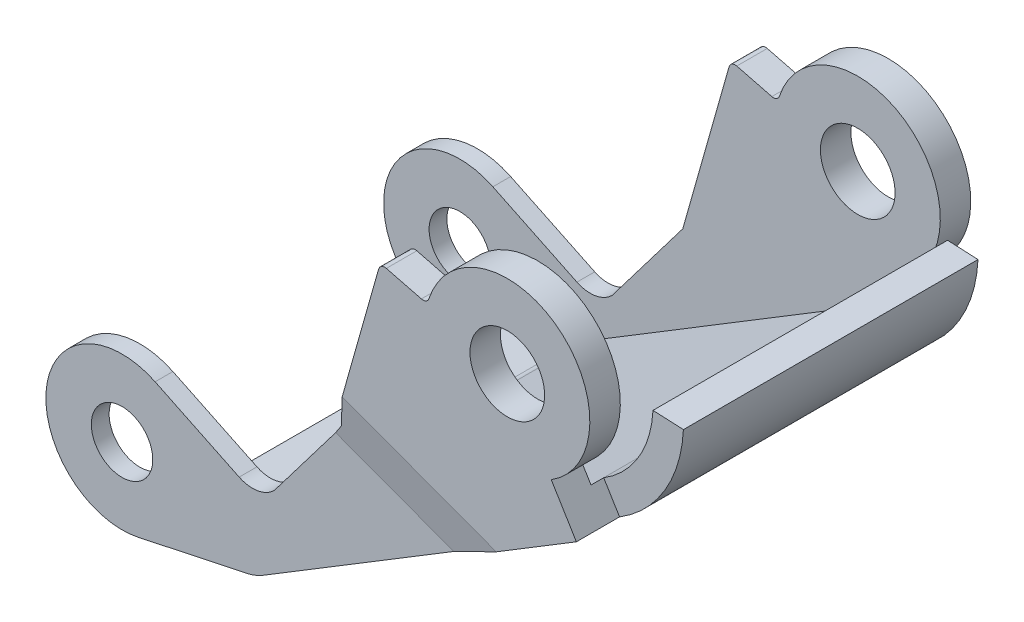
ISO-10303-21;
HEADER;
FILE_DESCRIPTION(('STEP AP214'),'2;1');
FILE_NAME('part.step','',(''),(''),'','','');
FILE_SCHEMA(('AUTOMOTIVE_DESIGN { 1 0 10303 214 1 1 1 1 }'));
ENDSEC;
DATA;
#1=APPLICATION_CONTEXT('core data for automotive mechanical design processes');
#2=APPLICATION_PROTOCOL_DEFINITION('international standard','automotive_design',2000,#1);
#3=PRODUCT_CONTEXT('',#1,'mechanical');
#4=PRODUCT('Part','Part','',(#3));
#5=PRODUCT_RELATED_PRODUCT_CATEGORY('part','',(#4));
#6=PRODUCT_DEFINITION_FORMATION('','',#4);
#7=PRODUCT_DEFINITION_CONTEXT('part definition',#1,'design');
#8=PRODUCT_DEFINITION('design','',#6,#7);
#9=PRODUCT_DEFINITION_SHAPE('','',#8);
#10=(LENGTH_UNIT() NAMED_UNIT(*) SI_UNIT(.MILLI.,.METRE.));
#11=(NAMED_UNIT(*) PLANE_ANGLE_UNIT() SI_UNIT($,.RADIAN.));
#12=(NAMED_UNIT(*) SI_UNIT($,.STERADIAN.) SOLID_ANGLE_UNIT());
#13=UNCERTAINTY_MEASURE_WITH_UNIT(LENGTH_MEASURE(1.E-05),#10,'distance_accuracy_value','');
#14=(GEOMETRIC_REPRESENTATION_CONTEXT(3) GLOBAL_UNCERTAINTY_ASSIGNED_CONTEXT((#13)) GLOBAL_UNIT_ASSIGNED_CONTEXT((#10,
#11,#12)) REPRESENTATION_CONTEXT('',''));
#15=CARTESIAN_POINT('',(0.,0.,0.));
#16=DIRECTION('',(0.,0.,1.));
#17=DIRECTION('',(1.,0.,0.));
#18=AXIS2_PLACEMENT_3D('',#15,#16,#17);
#19=CARTESIAN_POINT('',(-0.964109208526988,-12.0321565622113,-6.29999999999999));
#20=DIRECTION('',(0.,0.,-1.));
#21=DIRECTION('',(-1.,0.,0.));
#22=AXIS2_PLACEMENT_3D('',#19,#20,#21);
#23=CYLINDRICAL_SURFACE('',#22,0.800000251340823);
#24=DIRECTION('',(0.,0.,1.));
#25=VECTOR('',#24,1.);
#26=CARTESIAN_POINT('',(-0.548275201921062,-12.7155908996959,-6.29999999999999));
#27=LINE('',#26,#25);
#28=CARTESIAN_POINT('',(-0.548275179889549,-12.7155908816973,6.30000000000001));
#29=VERTEX_POINT('',#28);
#30=CARTESIAN_POINT('',(-0.548275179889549,-12.7155908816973,-6.29999999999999));
#31=VERTEX_POINT('',#30);
#32=EDGE_CURVE('E230',#29,#31,#27,.F.);
#33=ORIENTED_EDGE('',*,*,#32,.T.);
#34=CARTESIAN_POINT('',(-0.964109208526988,-12.0321565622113,-6.29999999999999));
#35=DIRECTION('',(0.,0.,-1.));
#36=DIRECTION('',(-1.,0.,0.));
#37=AXIS2_PLACEMENT_3D('',#34,#35,#36);
#38=CIRCLE('',#37,0.800000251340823);
#39=CARTESIAN_POINT('',(-0.798270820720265,-12.814779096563,-6.29999999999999));
#40=VERTEX_POINT('',#39);
#41=EDGE_CURVE('E19',#40,#31,#38,.F.);
#42=ORIENTED_EDGE('',*,*,#41,.F.);
#43=DIRECTION('',(0.,0.,1.));
#44=VECTOR('',#43,1.);
#45=CARTESIAN_POINT('',(-0.798270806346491,-12.8147790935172,-6.29999999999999));
#46=LINE('',#45,#44);
#47=CARTESIAN_POINT('',(-0.798270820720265,-12.814779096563,6.30000000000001));
#48=VERTEX_POINT('',#47);
#49=EDGE_CURVE('E257',#40,#48,#46,.T.);
#50=ORIENTED_EDGE('',*,*,#49,.T.);
#51=CARTESIAN_POINT('',(-0.964109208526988,-12.0321565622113,6.30000000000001));
#52=DIRECTION('',(0.,0.,-1.));
#53=DIRECTION('',(-1.,0.,0.));
#54=AXIS2_PLACEMENT_3D('',#51,#52,#53);
#55=CIRCLE('',#54,0.800000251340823);
#56=EDGE_CURVE('E285',#29,#48,#55,.T.);
#57=ORIENTED_EDGE('',*,*,#56,.F.);
#58=EDGE_LOOP('',(#33,#42,#50,#57));
#59=FACE_BOUND('',#58,.T.);
#60=ADVANCED_FACE('F16',(#59),#23,.F.);
#61=CARTESIAN_POINT('',(12.2958929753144,-4.90058589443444,-6.29999999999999));
#62=DIRECTION('',(0.519792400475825,-0.854292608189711,0.));
#63=DIRECTION('',(0.854292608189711,0.519792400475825,0.));
#64=AXIS2_PLACEMENT_3D('',#61,#62,#63);
#65=PLANE('',#64);
#66=DIRECTION('',(0.,0.,1.));
#67=VECTOR('',#66,1.);
#68=CARTESIAN_POINT('',(12.2958929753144,-4.90058589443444,-6.29999999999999));
#69=LINE('',#68,#67);
#70=CARTESIAN_POINT('',(12.2958929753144,-4.90058589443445,5.80000000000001));
#71=VERTEX_POINT('',#70);
#72=CARTESIAN_POINT('',(12.2958929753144,-4.90058589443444,6.30000000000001));
#73=VERTEX_POINT('',#72);
#74=EDGE_CURVE('E229',#71,#73,#69,.T.);
#75=ORIENTED_EDGE('',*,*,#74,.F.);
#76=DIRECTION('',(0.,0.,-1.));
#77=VECTOR('',#76,1.);
#78=CARTESIAN_POINT('',(12.2958929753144,-4.90058589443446,-7.49999999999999));
#79=LINE('',#78,#77);
#80=CARTESIAN_POINT('',(12.2958929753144,-4.90058589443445,-5.79999999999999));
#81=VERTEX_POINT('',#80);
#82=EDGE_CURVE('E225',#71,#81,#79,.T.);
#83=ORIENTED_EDGE('',*,*,#82,.T.);
#84=DIRECTION('',(0.,0.,1.));
#85=VECTOR('',#84,1.);
#86=CARTESIAN_POINT('',(12.2958929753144,-4.90058589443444,-6.29999999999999));
#87=LINE('',#86,#85);
#88=CARTESIAN_POINT('',(12.2958929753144,-4.90058589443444,-6.29999999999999));
#89=VERTEX_POINT('',#88);
#90=EDGE_CURVE('E219',#89,#81,#87,.T.);
#91=ORIENTED_EDGE('',*,*,#90,.F.);
#92=DIRECTION('',(0.854292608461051,0.519792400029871,0.));
#93=VECTOR('',#92,1.);
#94=CARTESIAN_POINT('',(-0.548275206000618,-12.715590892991,-6.29999999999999));
#95=LINE('',#94,#93);
#96=EDGE_CURVE('E223',#31,#89,#95,.T.);
#97=ORIENTED_EDGE('',*,*,#96,.F.);
#98=ORIENTED_EDGE('',*,*,#32,.F.);
#99=DIRECTION('',(0.854292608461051,0.519792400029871,0.));
#100=VECTOR('',#99,1.);
#101=CARTESIAN_POINT('',(-0.548275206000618,-12.715590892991,6.30000000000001));
#102=LINE('',#101,#100);
#103=EDGE_CURVE('E313',#29,#73,#102,.T.);
#104=ORIENTED_EDGE('',*,*,#103,.T.);
#105=EDGE_LOOP('',(#75,#83,#91,#97,#98,#104));
#106=FACE_BOUND('',#105,.T.);
#107=ADVANCED_FACE('F221',(#106),#65,.F.);
#108=CARTESIAN_POINT('',(-0.798270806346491,-12.8147790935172,-6.29999999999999));
#109=DIRECTION('',(0.207297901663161,-0.978277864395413,0.));
#110=DIRECTION('',(0.978277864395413,0.207297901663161,0.));
#111=AXIS2_PLACEMENT_3D('',#108,#109,#110);
#112=PLANE('',#111);
#113=ORIENTED_EDGE('',*,*,#49,.F.);
#114=DIRECTION('',(0.978277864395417,0.207297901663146,0.));
#115=VECTOR('',#114,1.);
#116=CARTESIAN_POINT('',(-3.75528007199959,-13.44137184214,-6.29999999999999));
#117=LINE('',#116,#115);
#118=CARTESIAN_POINT('',(-3.75528007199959,-13.44137184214,-6.29999999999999));
#119=VERTEX_POINT('',#118);
#120=EDGE_CURVE('E244',#119,#40,#117,.T.);
#121=ORIENTED_EDGE('',*,*,#120,.F.);
#122=DIRECTION('',(0.,0.,1.));
#123=VECTOR('',#122,1.);
#124=CARTESIAN_POINT('',(-3.75528007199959,-13.44137184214,-6.29999999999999));
#125=LINE('',#124,#123);
#126=CARTESIAN_POINT('',(-3.75528007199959,-13.44137184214,6.30000000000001));
#127=VERTEX_POINT('',#126);
#128=EDGE_CURVE('E291',#119,#127,#125,.T.);
#129=ORIENTED_EDGE('',*,*,#128,.T.);
#130=DIRECTION('',(0.978277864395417,0.207297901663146,0.));
#131=VECTOR('',#130,1.);
#132=CARTESIAN_POINT('',(-3.75528007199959,-13.44137184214,6.30000000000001));
#133=LINE('',#132,#131);
#134=EDGE_CURVE('E446',#127,#48,#133,.T.);
#135=ORIENTED_EDGE('',*,*,#134,.T.);
#136=EDGE_LOOP('',(#113,#121,#129,#135));
#137=FACE_BOUND('',#136,.T.);
#138=ADVANCED_FACE('F452',(#137),#112,.F.);
#139=CARTESIAN_POINT('',(2.05669511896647,-3.86680197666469,-6.29999999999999));
#140=DIRECTION('',(0.,0.,1.));
#141=DIRECTION('',(1.,0.,0.));
#142=AXIS2_PLACEMENT_3D('',#139,#140,#141);
#143=PLANE('',#142);
#144=DIRECTION('',(-0.90088793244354,0.43405176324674,0.));
#145=VECTOR('',#144,1.);
#146=CARTESIAN_POINT('',(-4.16870308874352,-9.26227249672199,-6.29999999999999));
#147=LINE('',#146,#145);
#148=CARTESIAN_POINT('',(-4.16870308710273,-9.26227249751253,-6.29999999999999));
#149=VERTEX_POINT('',#148);
#150=CARTESIAN_POINT('',(-0.858519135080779,-10.8571336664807,-6.29999999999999));
#151=VERTEX_POINT('',#150);
#152=EDGE_CURVE('E279',#149,#151,#147,.F.);
#153=ORIENTED_EDGE('',*,*,#152,.F.);
#154=CARTESIAN_POINT('',(-5.47085837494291,-11.9649362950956,-6.29999999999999));
#155=DIRECTION('',(0.,0.,-1.));
#156=DIRECTION('',(-1.,0.,0.));
#157=AXIS2_PLACEMENT_3D('',#154,#155,#156);
#158=CIRCLE('',#157,2.99999999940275);
#159=CARTESIAN_POINT('',(-4.8489646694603,-14.8997698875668,-6.29999999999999));
#160=VERTEX_POINT('',#159);
#161=EDGE_CURVE('E436',#160,#149,#158,.T.);
#162=ORIENTED_EDGE('',*,*,#161,.F.);
#163=DIRECTION('',(0.978277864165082,0.207297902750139,0.));
#164=VECTOR('',#163,1.);
#165=CARTESIAN_POINT('',(-4.8489646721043,-14.8997698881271,-6.29999999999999));
#166=LINE('',#165,#164);
#167=CARTESIAN_POINT('',(-3.50652258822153,-14.6153052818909,-6.29999999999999));
#168=VERTEX_POINT('',#167);
#169=EDGE_CURVE('E246',#160,#168,#166,.T.);
#170=ORIENTED_EDGE('',*,*,#169,.T.);
#171=DIRECTION('',(-0.207297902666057,0.978277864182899,0.));
#172=VECTOR('',#171,1.);
#173=CARTESIAN_POINT('',(-3.75528007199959,-13.44137184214,-6.29999999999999));
#174=LINE('',#173,#172);
#175=EDGE_CURVE('E295',#168,#119,#174,.T.);
#176=ORIENTED_EDGE('',*,*,#175,.T.);
#177=ORIENTED_EDGE('',*,*,#120,.T.);
#178=ORIENTED_EDGE('',*,*,#41,.T.);
#179=ORIENTED_EDGE('',*,*,#96,.T.);
#180=DIRECTION('',(-0.519792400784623,0.854292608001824,0.));
#181=VECTOR('',#180,1.);
#182=CARTESIAN_POINT('',(12.2958929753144,-4.90058589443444,-6.29999999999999));
#183=LINE('',#182,#181);
#184=CARTESIAN_POINT('',(11.9318383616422,-4.30225247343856,-6.29999999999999));
#185=VERTEX_POINT('',#184);
#186=EDGE_CURVE('E234',#89,#185,#183,.T.);
#187=ORIENTED_EDGE('',*,*,#186,.T.);
#188=CARTESIAN_POINT('',(10.1999983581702,-1.55211971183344,-6.29999999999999));
#189=DIRECTION('',(0.,0.,-1.));
#190=DIRECTION('',(-1.,0.,0.));
#191=AXIS2_PLACEMENT_3D('',#188,#189,#190);
#192=CIRCLE('',#191,3.25000000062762);
#193=CARTESIAN_POINT('',(7.11523356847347,-0.529023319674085,-6.29999999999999));
#194=VERTEX_POINT('',#193);
#195=EDGE_CURVE('E431',#194,#185,#192,.T.);
#196=ORIENTED_EDGE('',*,*,#195,.F.);
#197=CARTESIAN_POINT('',(6.87794396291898,-0.450323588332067,-6.29999999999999));
#198=DIRECTION('',(0.,0.,-1.));
#199=DIRECTION('',(-1.,0.,0.));
#200=AXIS2_PLACEMENT_3D('',#197,#198,#199);
#201=CIRCLE('',#200,0.250000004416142);
#202=CARTESIAN_POINT('',(6.8163945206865,-0.692628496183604,-6.29999999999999));
#203=VERTEX_POINT('',#202);
#204=EDGE_CURVE('E278',#194,#203,#201,.T.);
#205=ORIENTED_EDGE('',*,*,#204,.T.);
#206=DIRECTION('',(-0.96921961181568,0.246197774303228,0.));
#207=VECTOR('',#206,1.);
#208=CARTESIAN_POINT('',(5.43579761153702,-0.341934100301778,-6.29999999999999));
#209=LINE('',#208,#207);
#210=CARTESIAN_POINT('',(5.43579761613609,-0.341934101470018,-6.29999999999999));
#211=VERTEX_POINT('',#210);
#212=EDGE_CURVE('E274',#211,#203,#209,.F.);
#213=ORIENTED_EDGE('',*,*,#212,.F.);
#214=CARTESIAN_POINT('',(5.37424817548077,-0.584239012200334,-6.29999999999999));
#215=DIRECTION('',(0.,0.,-1.));
#216=DIRECTION('',(-1.,0.,0.));
#217=AXIS2_PLACEMENT_3D('',#214,#215,#216);
#218=CIRCLE('',#217,0.250000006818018);
#219=CARTESIAN_POINT('',(5.1337042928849,-0.516131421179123,-6.29999999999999));
#220=VERTEX_POINT('',#219);
#221=EDGE_CURVE('E425',#220,#211,#218,.T.);
#222=ORIENTED_EDGE('',*,*,#221,.F.);
#223=DIRECTION('',(-0.272430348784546,-0.962175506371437,0.));
#224=VECTOR('',#223,1.);
#225=CARTESIAN_POINT('',(3.31111393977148,-6.9531961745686,-6.29999999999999));
#226=LINE('',#225,#224);
#227=CARTESIAN_POINT('',(3.31111393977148,-6.9531961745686,-6.29999999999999));
#228=VERTEX_POINT('',#227);
#229=EDGE_CURVE('E260',#228,#220,#226,.F.);
#230=ORIENTED_EDGE('',*,*,#229,.F.);
#231=DIRECTION('',(-0.60489273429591,-0.796306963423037,0.));
#232=VECTOR('',#231,1.);
#233=CARTESIAN_POINT('',(0.528347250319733,-10.6165506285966,-6.29999999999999));
#234=LINE('',#233,#232);
#235=CARTESIAN_POINT('',(0.52834725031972,-10.6165506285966,-6.29999999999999));
#236=VERTEX_POINT('',#235);
#237=EDGE_CURVE('E267',#236,#228,#234,.F.);
#238=ORIENTED_EDGE('',*,*,#237,.F.);
#239=CARTESIAN_POINT('',(-0.333316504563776,-9.76705926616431,-6.29999999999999));
#240=DIRECTION('',(0.,0.,-1.));
#241=DIRECTION('',(-1.,0.,0.));
#242=AXIS2_PLACEMENT_3D('',#239,#240,#241);
#243=CIRCLE('',#242,1.21000000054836);
#244=EDGE_CURVE('E434',#236,#151,#243,.T.);
#245=ORIENTED_EDGE('',*,*,#244,.T.);
#246=EDGE_LOOP('',(#153,#162,#170,#176,#177,#178,#179,#187,#196,#205,#213,#222,#230,#238,#245));
#247=FACE_BOUND('',#246,.T.);
#248=CARTESIAN_POINT('',(10.19999836,-1.55211971,-6.29999999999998));
#249=DIRECTION('',(0.,0.,-1.));
#250=DIRECTION('',(-1.,0.,0.));
#251=AXIS2_PLACEMENT_3D('',#248,#249,#250);
#252=CIRCLE('',#251,1.47);
#253=CARTESIAN_POINT('',(8.72999836,-1.55211971,-6.29999999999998));
#254=VERTEX_POINT('',#253);
#255=EDGE_CURVE('E422',#254,#254,#252,.T.);
#256=ORIENTED_EDGE('',*,*,#255,.T.);
#257=EDGE_LOOP('',(#256));
#258=FACE_BOUND('',#257,.T.);
#259=CARTESIAN_POINT('',(-5.47085844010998,-11.9649360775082,-6.29999999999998));
#260=DIRECTION('',(0.,0.,-1.));
#261=DIRECTION('',(-1.,0.,0.));
#262=AXIS2_PLACEMENT_3D('',#259,#260,#261);
#263=CIRCLE('',#262,1.21);
#264=CARTESIAN_POINT('',(-6.68085844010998,-11.9649360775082,-6.29999999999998));
#265=VERTEX_POINT('',#264);
#266=EDGE_CURVE('E271',#265,#265,#263,.T.);
#267=ORIENTED_EDGE('',*,*,#266,.T.);
#268=EDGE_LOOP('',(#267));
#269=FACE_BOUND('',#268,.T.);
#270=ADVANCED_FACE('F242',(#247,#258,#269),#143,.T.);
#271=CARTESIAN_POINT('',(10.1907337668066,-1.44070084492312,-7.49999999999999));
#272=DIRECTION('',(0.,0.,-1.));
#273=DIRECTION('',(-1.,0.,0.));
#274=AXIS2_PLACEMENT_3D('',#271,#272,#273);
#275=CYLINDRICAL_SURFACE('',#274,4.0499999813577);
#276=ORIENTED_EDGE('',*,*,#82,.F.);
#277=CARTESIAN_POINT('',(10.1907337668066,-1.44070084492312,5.80000000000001));
#278=DIRECTION('',(0.,0.,-1.));
#279=DIRECTION('',(-1.,0.,0.));
#280=AXIS2_PLACEMENT_3D('',#277,#278,#279);
#281=CIRCLE('',#280,4.0499999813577);
#282=CARTESIAN_POINT('',(14.2361392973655,-1.63355815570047,5.80000000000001));
#283=VERTEX_POINT('',#282);
#284=EDGE_CURVE('E414',#283,#71,#281,.T.);
#285=ORIENTED_EDGE('',*,*,#284,.F.);
#286=DIRECTION('',(0.,0.,1.));
#287=VECTOR('',#286,1.);
#288=CARTESIAN_POINT('',(14.2361392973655,-1.63355815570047,-7.49999999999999));
#289=LINE('',#288,#287);
#290=CARTESIAN_POINT('',(14.2361392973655,-1.63355815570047,-5.79999999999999));
#291=VERTEX_POINT('',#290);
#292=EDGE_CURVE('E482',#291,#283,#289,.T.);
#293=ORIENTED_EDGE('',*,*,#292,.F.);
#294=CARTESIAN_POINT('',(10.1907337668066,-1.44070084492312,-5.79999999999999));
#295=DIRECTION('',(0.,0.,-1.));
#296=DIRECTION('',(-1.,0.,0.));
#297=AXIS2_PLACEMENT_3D('',#294,#295,#296);
#298=CIRCLE('',#297,4.0499999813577);
#299=EDGE_CURVE('E419',#291,#81,#298,.T.);
#300=ORIENTED_EDGE('',*,*,#299,.T.);
#301=EDGE_LOOP('',(#276,#285,#293,#300));
#302=FACE_BOUND('',#301,.T.);
#303=ADVANCED_FACE('F714',(#302),#275,.F.);
#304=CARTESIAN_POINT('',(2.05669511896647,-3.86680197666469,6.30000000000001));
#305=DIRECTION('',(0.,0.,1.));
#306=DIRECTION('',(1.,0.,0.));
#307=AXIS2_PLACEMENT_3D('',#304,#305,#306);
#308=PLANE('',#307);
#309=DIRECTION('',(-0.90088793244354,0.43405176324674,0.));
#310=VECTOR('',#309,1.);
#311=CARTESIAN_POINT('',(-4.16870308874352,-9.26227249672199,6.30000000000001));
#312=LINE('',#311,#310);
#313=CARTESIAN_POINT('',(-0.85851913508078,-10.8571336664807,6.30000000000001));
#314=VERTEX_POINT('',#313);
#315=CARTESIAN_POINT('',(-4.16870308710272,-9.26227249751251,6.30000000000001));
#316=VERTEX_POINT('',#315);
#317=EDGE_CURVE('E466',#314,#316,#312,.T.);
#318=ORIENTED_EDGE('',*,*,#317,.F.);
#319=CARTESIAN_POINT('',(-0.333316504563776,-9.76705926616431,6.30000000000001));
#320=DIRECTION('',(0.,0.,-1.));
#321=DIRECTION('',(-1.,0.,0.));
#322=AXIS2_PLACEMENT_3D('',#319,#320,#321);
#323=CIRCLE('',#322,1.21000000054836);
#324=CARTESIAN_POINT('',(0.52834725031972,-10.6165506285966,6.30000000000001));
#325=VERTEX_POINT('',#324);
#326=EDGE_CURVE('E393',#314,#325,#323,.F.);
#327=ORIENTED_EDGE('',*,*,#326,.T.);
#328=DIRECTION('',(-0.60489273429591,-0.796306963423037,0.));
#329=VECTOR('',#328,1.);
#330=CARTESIAN_POINT('',(0.528347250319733,-10.6165506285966,6.30000000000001));
#331=LINE('',#330,#329);
#332=CARTESIAN_POINT('',(3.31111393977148,-6.9531961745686,6.30000000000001));
#333=VERTEX_POINT('',#332);
#334=EDGE_CURVE('E396',#333,#325,#331,.T.);
#335=ORIENTED_EDGE('',*,*,#334,.F.);
#336=DIRECTION('',(-0.272430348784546,-0.962175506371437,0.));
#337=VECTOR('',#336,1.);
#338=CARTESIAN_POINT('',(3.31111393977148,-6.9531961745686,6.30000000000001));
#339=LINE('',#338,#337);
#340=CARTESIAN_POINT('',(5.1337042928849,-0.516131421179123,6.30000000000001));
#341=VERTEX_POINT('',#340);
#342=EDGE_CURVE('E401',#341,#333,#339,.T.);
#343=ORIENTED_EDGE('',*,*,#342,.F.);
#344=CARTESIAN_POINT('',(5.37424817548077,-0.584239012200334,6.30000000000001));
#345=DIRECTION('',(0.,0.,-1.));
#346=DIRECTION('',(-1.,0.,0.));
#347=AXIS2_PLACEMENT_3D('',#344,#345,#346);
#348=CIRCLE('',#347,0.250000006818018);
#349=CARTESIAN_POINT('',(5.43579761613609,-0.341934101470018,6.30000000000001));
#350=VERTEX_POINT('',#349);
#351=EDGE_CURVE('E402',#350,#341,#348,.F.);
#352=ORIENTED_EDGE('',*,*,#351,.F.);
#353=DIRECTION('',(-0.96921961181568,0.246197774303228,0.));
#354=VECTOR('',#353,1.);
#355=CARTESIAN_POINT('',(5.43579761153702,-0.341934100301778,6.30000000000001));
#356=LINE('',#355,#354);
#357=CARTESIAN_POINT('',(6.8163945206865,-0.692628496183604,6.30000000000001));
#358=VERTEX_POINT('',#357);
#359=EDGE_CURVE('E409',#358,#350,#356,.T.);
#360=ORIENTED_EDGE('',*,*,#359,.F.);
#361=CARTESIAN_POINT('',(6.87794396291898,-0.450323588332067,6.30000000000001));
#362=DIRECTION('',(0.,0.,-1.));
#363=DIRECTION('',(-1.,0.,0.));
#364=AXIS2_PLACEMENT_3D('',#361,#362,#363);
#365=CIRCLE('',#364,0.250000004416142);
#366=CARTESIAN_POINT('',(7.11523356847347,-0.529023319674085,6.30000000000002));
#367=VERTEX_POINT('',#366);
#368=EDGE_CURVE('E406',#358,#367,#365,.F.);
#369=ORIENTED_EDGE('',*,*,#368,.T.);
#370=CARTESIAN_POINT('',(10.1999983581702,-1.55211971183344,6.30000000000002));
#371=DIRECTION('',(0.,0.,-1.));
#372=DIRECTION('',(-1.,0.,0.));
#373=AXIS2_PLACEMENT_3D('',#370,#371,#372);
#374=CIRCLE('',#373,3.25000000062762);
#375=CARTESIAN_POINT('',(11.9318383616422,-4.30225247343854,6.30000000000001));
#376=VERTEX_POINT('',#375);
#377=EDGE_CURVE('E411',#376,#367,#374,.F.);
#378=ORIENTED_EDGE('',*,*,#377,.F.);
#379=DIRECTION('',(-0.519792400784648,0.854292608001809,0.));
#380=VECTOR('',#379,1.);
#381=CARTESIAN_POINT('',(11.9318383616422,-4.30225247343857,6.30000000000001));
#382=LINE('',#381,#380);
#383=EDGE_CURVE('E417',#73,#376,#382,.T.);
#384=ORIENTED_EDGE('',*,*,#383,.F.);
#385=ORIENTED_EDGE('',*,*,#103,.F.);
#386=ORIENTED_EDGE('',*,*,#56,.T.);
#387=ORIENTED_EDGE('',*,*,#134,.F.);
#388=DIRECTION('',(-0.207297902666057,0.978277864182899,0.));
#389=VECTOR('',#388,1.);
#390=CARTESIAN_POINT('',(-3.75528007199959,-13.44137184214,6.30000000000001));
#391=LINE('',#390,#389);
#392=CARTESIAN_POINT('',(-3.50652258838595,-14.6153052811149,6.30000000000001));
#393=VERTEX_POINT('',#392);
#394=EDGE_CURVE('E294',#127,#393,#391,.F.);
#395=ORIENTED_EDGE('',*,*,#394,.T.);
#396=DIRECTION('',(0.978277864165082,0.207297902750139,0.));
#397=VECTOR('',#396,1.);
#398=CARTESIAN_POINT('',(-4.8489646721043,-14.8997698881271,6.30000000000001));
#399=LINE('',#398,#397);
#400=CARTESIAN_POINT('',(-4.8489646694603,-14.8997698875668,6.30000000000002));
#401=VERTEX_POINT('',#400);
#402=EDGE_CURVE('E454',#401,#393,#399,.T.);
#403=ORIENTED_EDGE('',*,*,#402,.F.);
#404=CARTESIAN_POINT('',(-5.47085837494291,-11.9649362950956,6.30000000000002));
#405=DIRECTION('',(0.,0.,-1.));
#406=DIRECTION('',(-1.,0.,0.));
#407=AXIS2_PLACEMENT_3D('',#404,#405,#406);
#408=CIRCLE('',#407,2.99999999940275);
#409=EDGE_CURVE('E389',#316,#401,#408,.F.);
#410=ORIENTED_EDGE('',*,*,#409,.F.);
#411=EDGE_LOOP('',(#318,#327,#335,#343,#352,#360,#369,#378,#384,#385,#386,#387,#395,#403,#410));
#412=FACE_BOUND('',#411,.T.);
#413=CARTESIAN_POINT('',(10.19999836,-1.55211971,6.30000000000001));
#414=DIRECTION('',(0.,0.,-1.));
#415=DIRECTION('',(-1.,0.,0.));
#416=AXIS2_PLACEMENT_3D('',#413,#414,#415);
#417=CIRCLE('',#416,1.47);
#418=CARTESIAN_POINT('',(8.72999836,-1.55211971,6.30000000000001));
#419=VERTEX_POINT('',#418);
#420=EDGE_CURVE('E397',#419,#419,#417,.F.);
#421=ORIENTED_EDGE('',*,*,#420,.T.);
#422=EDGE_LOOP('',(#421));
#423=FACE_BOUND('',#422,.T.);
#424=CARTESIAN_POINT('',(-5.47085844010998,-11.9649360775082,6.30000000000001));
#425=DIRECTION('',(0.,0.,-1.));
#426=DIRECTION('',(-1.,0.,0.));
#427=AXIS2_PLACEMENT_3D('',#424,#425,#426);
#428=CIRCLE('',#427,1.21);
#429=CARTESIAN_POINT('',(-6.68085844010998,-11.9649360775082,6.30000000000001));
#430=VERTEX_POINT('',#429);
#431=EDGE_CURVE('E386',#430,#430,#428,.F.);
#432=ORIENTED_EDGE('',*,*,#431,.T.);
#433=EDGE_LOOP('',(#432));
#434=FACE_BOUND('',#433,.T.);
#435=ADVANCED_FACE('F443',(#412,#423,#434),#308,.F.);
#436=CARTESIAN_POINT('',(-3.75528007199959,-13.44137184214,-6.29999999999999));
#437=DIRECTION('',(0.978277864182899,0.207297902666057,0.));
#438=DIRECTION('',(-0.207297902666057,0.978277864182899,0.));
#439=AXIS2_PLACEMENT_3D('',#436,#437,#438);
#440=PLANE('',#439);
#441=ORIENTED_EDGE('',*,*,#128,.F.);
#442=ORIENTED_EDGE('',*,*,#175,.F.);
#443=DIRECTION('',(0.,0.,1.));
#444=VECTOR('',#443,1.);
#445=CARTESIAN_POINT('',(-3.50652258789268,-14.6153052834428,-7.49999999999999));
#446=LINE('',#445,#444);
#447=EDGE_CURVE('E302',#393,#168,#446,.F.);
#448=ORIENTED_EDGE('',*,*,#447,.F.);
#449=ORIENTED_EDGE('',*,*,#394,.F.);
#450=EDGE_LOOP('',(#441,#442,#448,#449));
#451=FACE_BOUND('',#450,.T.);
#452=ADVANCED_FACE('F722',(#451),#440,.F.);
#453=CARTESIAN_POINT('',(-5.47085844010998,-11.9649360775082,0.));
#454=DIRECTION('',(0.,0.,-1.));
#455=DIRECTION('',(-1.,0.,0.));
#456=AXIS2_PLACEMENT_3D('',#453,#454,#455);
#457=CYLINDRICAL_SURFACE('',#456,1.21);
#458=ORIENTED_EDGE('',*,*,#266,.F.);
#459=EDGE_LOOP('',(#458));
#460=FACE_BOUND('',#459,.T.);
#461=CARTESIAN_POINT('',(-5.47085844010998,-11.9649360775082,-6.99999999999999));
#462=DIRECTION('',(0.,0.,-1.));
#463=DIRECTION('',(-1.,0.,0.));
#464=AXIS2_PLACEMENT_3D('',#461,#462,#463);
#465=CIRCLE('',#464,1.21);
#466=CARTESIAN_POINT('',(-6.68085844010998,-11.9649360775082,-6.99999999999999));
#467=VERTEX_POINT('',#466);
#468=EDGE_CURVE('E382',#467,#467,#465,.F.);
#469=ORIENTED_EDGE('',*,*,#468,.F.);
#470=EDGE_LOOP('',(#469));
#471=FACE_BOUND('',#470,.T.);
#472=ADVANCED_FACE('F849',(#460,#471),#457,.F.);
#473=CARTESIAN_POINT('',(0.528347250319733,-10.6165506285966,-7.49999999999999));
#474=DIRECTION('',(-0.796306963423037,0.60489273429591,0.));
#475=DIRECTION('',(-0.60489273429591,-0.796306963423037,0.));
#476=AXIS2_PLACEMENT_3D('',#473,#474,#475);
#477=PLANE('',#476);
#478=DIRECTION('',(0.,0.,1.));
#479=VECTOR('',#478,1.);
#480=CARTESIAN_POINT('',(3.31111393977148,-6.9531961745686,-7.49999999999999));
#481=LINE('',#480,#479);
#482=CARTESIAN_POINT('',(3.31111393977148,-6.9531961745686,-7.1465317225));
#483=VERTEX_POINT('',#482);
#484=EDGE_CURVE('E264',#483,#228,#481,.T.);
#485=ORIENTED_EDGE('',*,*,#484,.F.);
#486=DIRECTION('',(-0.588284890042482,-0.774443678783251,0.232718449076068));
#487=VECTOR('',#486,1.);
#488=CARTESIAN_POINT('',(3.31111393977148,-6.9531961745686,-7.1465317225));
#489=LINE('',#488,#487);
#490=CARTESIAN_POINT('',(2.94069896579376,-7.44082647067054,-7.));
#491=VERTEX_POINT('',#490);
#492=EDGE_CURVE('E270',#483,#491,#489,.T.);
#493=ORIENTED_EDGE('',*,*,#492,.T.);
#494=DIRECTION('',(0.604892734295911,0.796306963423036,0.));
#495=VECTOR('',#494,1.);
#496=CARTESIAN_POINT('',(0.528347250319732,-10.6165506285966,-7.));
#497=LINE('',#496,#495);
#498=CARTESIAN_POINT('',(0.528347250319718,-10.6165506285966,-7.));
#499=VERTEX_POINT('',#498);
#500=EDGE_CURVE('E385',#499,#491,#497,.T.);
#501=ORIENTED_EDGE('',*,*,#500,.F.);
#502=DIRECTION('',(0.,0.,-1.));
#503=VECTOR('',#502,1.);
#504=CARTESIAN_POINT('',(0.528347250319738,-10.6165506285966,-7.49999999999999));
#505=LINE('',#504,#503);
#506=EDGE_CURVE('E282',#499,#236,#505,.F.);
#507=ORIENTED_EDGE('',*,*,#506,.T.);
#508=ORIENTED_EDGE('',*,*,#237,.T.);
#509=EDGE_LOOP('',(#485,#493,#501,#507,#508));
#510=FACE_BOUND('',#509,.T.);
#511=ADVANCED_FACE('F525',(#510),#477,.T.);
#512=CARTESIAN_POINT('',(-5.47085837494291,-11.9649362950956,-7.49999999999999));
#513=DIRECTION('',(0.,0.,-1.));
#514=DIRECTION('',(-1.,0.,0.));
#515=AXIS2_PLACEMENT_3D('',#512,#513,#514);
#516=CYLINDRICAL_SURFACE('',#515,2.99999999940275);
#517=DIRECTION('',(0.,0.,1.));
#518=VECTOR('',#517,1.);
#519=CARTESIAN_POINT('',(-4.16870308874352,-9.26227249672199,-7.49999999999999));
#520=LINE('',#519,#518);
#521=CARTESIAN_POINT('',(-4.16870308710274,-9.26227249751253,-7.));
#522=VERTEX_POINT('',#521);
#523=EDGE_CURVE('E283',#522,#149,#520,.T.);
#524=ORIENTED_EDGE('',*,*,#523,.F.);
#525=CARTESIAN_POINT('',(-5.47085837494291,-11.9649362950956,-7.));
#526=DIRECTION('',(0.,0.,-1.));
#527=DIRECTION('',(-1.,0.,0.));
#528=AXIS2_PLACEMENT_3D('',#525,#526,#527);
#529=CIRCLE('',#528,2.99999999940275);
#530=CARTESIAN_POINT('',(-4.84896467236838,-14.8997698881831,-7.));
#531=VERTEX_POINT('',#530);
#532=EDGE_CURVE('E378',#531,#522,#529,.T.);
#533=ORIENTED_EDGE('',*,*,#532,.F.);
#534=DIRECTION('',(0.,0.,1.));
#535=VECTOR('',#534,1.);
#536=CARTESIAN_POINT('',(-4.8489646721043,-14.8997698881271,-7.49999999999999));
#537=LINE('',#536,#535);
#538=EDGE_CURVE('E305',#160,#531,#537,.F.);
#539=ORIENTED_EDGE('',*,*,#538,.F.);
#540=ORIENTED_EDGE('',*,*,#161,.T.);
#541=EDGE_LOOP('',(#524,#533,#539,#540));
#542=FACE_BOUND('',#541,.T.);
#543=ADVANCED_FACE('F842',(#542),#516,.T.);
#544=CARTESIAN_POINT('',(-4.16870308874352,-9.26227249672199,-7.49999999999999));
#545=DIRECTION('',(0.43405176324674,0.90088793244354,0.));
#546=DIRECTION('',(-0.90088793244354,0.43405176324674,0.));
#547=AXIS2_PLACEMENT_3D('',#544,#545,#546);
#548=PLANE('',#547);
#549=ORIENTED_EDGE('',*,*,#152,.T.);
#550=DIRECTION('',(0.,0.,-1.));
#551=VECTOR('',#550,1.);
#552=CARTESIAN_POINT('',(-0.858519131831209,-10.8571336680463,-7.49999999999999));
#553=LINE('',#552,#551);
#554=CARTESIAN_POINT('',(-0.858519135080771,-10.8571336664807,-7.));
#555=VERTEX_POINT('',#554);
#556=EDGE_CURVE('E433',#151,#555,#553,.T.);
#557=ORIENTED_EDGE('',*,*,#556,.T.);
#558=DIRECTION('',(0.900887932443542,-0.434051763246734,0.));
#559=VECTOR('',#558,1.);
#560=CARTESIAN_POINT('',(-4.16870308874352,-9.26227249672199,-7.));
#561=LINE('',#560,#559);
#562=EDGE_CURVE('E377',#522,#555,#561,.T.);
#563=ORIENTED_EDGE('',*,*,#562,.F.);
#564=ORIENTED_EDGE('',*,*,#523,.T.);
#565=EDGE_LOOP('',(#549,#557,#563,#564));
#566=FACE_BOUND('',#565,.T.);
#567=ADVANCED_FACE('F838',(#566),#548,.T.);
#568=CARTESIAN_POINT('',(-0.333316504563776,-9.76705926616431,-7.49999999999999));
#569=DIRECTION('',(0.,0.,-1.));
#570=DIRECTION('',(-1.,0.,0.));
#571=AXIS2_PLACEMENT_3D('',#568,#569,#570);
#572=CYLINDRICAL_SURFACE('',#571,1.21000000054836);
#573=ORIENTED_EDGE('',*,*,#556,.F.);
#574=ORIENTED_EDGE('',*,*,#244,.F.);
#575=ORIENTED_EDGE('',*,*,#506,.F.);
#576=CARTESIAN_POINT('',(-0.333316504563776,-9.76705926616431,-7.));
#577=DIRECTION('',(0.,0.,-1.));
#578=DIRECTION('',(-1.,0.,0.));
#579=AXIS2_PLACEMENT_3D('',#576,#577,#578);
#580=CIRCLE('',#579,1.21000000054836);
#581=EDGE_CURVE('E373',#555,#499,#580,.F.);
#582=ORIENTED_EDGE('',*,*,#581,.F.);
#583=EDGE_LOOP('',(#573,#574,#575,#582));
#584=FACE_BOUND('',#583,.T.);
#585=ADVANCED_FACE('F834',(#584),#572,.F.);
#586=CARTESIAN_POINT('',(10.1999983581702,-1.55211971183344,-7.49999999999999));
#587=DIRECTION('',(0.,0.,-1.));
#588=DIRECTION('',(-1.,0.,0.));
#589=AXIS2_PLACEMENT_3D('',#586,#587,#588);
#590=CYLINDRICAL_SURFACE('',#589,3.25000000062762);
#591=DIRECTION('',(0.,0.,-1.));
#592=VECTOR('',#591,1.);
#593=CARTESIAN_POINT('',(7.11523356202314,-0.529023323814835,-7.49999999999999));
#594=LINE('',#593,#592);
#595=CARTESIAN_POINT('',(7.11523356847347,-0.529023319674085,-7.49999999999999));
#596=VERTEX_POINT('',#595);
#597=EDGE_CURVE('E430',#596,#194,#594,.F.);
#598=ORIENTED_EDGE('',*,*,#597,.T.);
#599=ORIENTED_EDGE('',*,*,#195,.T.);
#600=DIRECTION('',(0.,0.,1.));
#601=VECTOR('',#600,1.);
#602=CARTESIAN_POINT('',(11.9318383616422,-4.30225247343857,-7.49999999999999));
#603=LINE('',#602,#601);
#604=CARTESIAN_POINT('',(11.9318383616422,-4.30225247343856,-7.49999999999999));
#605=VERTEX_POINT('',#604);
#606=EDGE_CURVE('E239',#605,#185,#603,.T.);
#607=ORIENTED_EDGE('',*,*,#606,.F.);
#608=CARTESIAN_POINT('',(10.1999983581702,-1.55211971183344,-7.49999999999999));
#609=DIRECTION('',(0.,0.,-1.));
#610=DIRECTION('',(-1.,0.,0.));
#611=AXIS2_PLACEMENT_3D('',#608,#609,#610);
#612=CIRCLE('',#611,3.25000000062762);
#613=EDGE_CURVE('E370',#605,#596,#612,.F.);
#614=ORIENTED_EDGE('',*,*,#613,.T.);
#615=EDGE_LOOP('',(#598,#599,#607,#614));
#616=FACE_BOUND('',#615,.T.);
#617=ADVANCED_FACE('F830',(#616),#590,.T.);
#618=CARTESIAN_POINT('',(6.87794396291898,-0.450323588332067,-7.49999999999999));
#619=DIRECTION('',(0.,0.,-1.));
#620=DIRECTION('',(-1.,0.,0.));
#621=AXIS2_PLACEMENT_3D('',#618,#619,#620);
#622=CYLINDRICAL_SURFACE('',#621,0.250000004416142);
#623=ORIENTED_EDGE('',*,*,#597,.F.);
#624=CARTESIAN_POINT('',(6.87794396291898,-0.450323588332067,-7.49999999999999));
#625=DIRECTION('',(0.,0.,-1.));
#626=DIRECTION('',(-1.,0.,0.));
#627=AXIS2_PLACEMENT_3D('',#624,#625,#626);
#628=CIRCLE('',#627,0.250000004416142);
#629=CARTESIAN_POINT('',(6.8163945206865,-0.692628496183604,-7.49999999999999));
#630=VERTEX_POINT('',#629);
#631=EDGE_CURVE('E368',#596,#630,#628,.T.);
#632=ORIENTED_EDGE('',*,*,#631,.T.);
#633=DIRECTION('',(0.,0.,1.));
#634=VECTOR('',#633,1.);
#635=CARTESIAN_POINT('',(6.81639452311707,-0.692628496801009,-7.49999999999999));
#636=LINE('',#635,#634);
#637=EDGE_CURVE('E277',#203,#630,#636,.F.);
#638=ORIENTED_EDGE('',*,*,#637,.F.);
#639=ORIENTED_EDGE('',*,*,#204,.F.);
#640=EDGE_LOOP('',(#623,#632,#638,#639));
#641=FACE_BOUND('',#640,.T.);
#642=ADVANCED_FACE('F826',(#641),#622,.F.);
#643=CARTESIAN_POINT('',(5.43579761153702,-0.341934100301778,-7.49999999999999));
#644=DIRECTION('',(0.246197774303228,0.96921961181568,0.));
#645=DIRECTION('',(-0.96921961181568,0.246197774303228,0.));
#646=AXIS2_PLACEMENT_3D('',#643,#644,#645);
#647=PLANE('',#646);
#648=DIRECTION('',(-0.96921961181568,0.246197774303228,0.));
#649=VECTOR('',#648,1.);
#650=CARTESIAN_POINT('',(6.81639452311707,-0.692628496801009,-7.49999999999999));
#651=LINE('',#650,#649);
#652=CARTESIAN_POINT('',(5.43579761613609,-0.341934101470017,-7.49999999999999));
#653=VERTEX_POINT('',#652);
#654=EDGE_CURVE('E367',#630,#653,#651,.T.);
#655=ORIENTED_EDGE('',*,*,#654,.T.);
#656=DIRECTION('',(0.,0.,-1.));
#657=VECTOR('',#656,1.);
#658=CARTESIAN_POINT('',(5.43579761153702,-0.341934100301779,-7.49999999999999));
#659=LINE('',#658,#657);
#660=EDGE_CURVE('E428',#211,#653,#659,.T.);
#661=ORIENTED_EDGE('',*,*,#660,.F.);
#662=ORIENTED_EDGE('',*,*,#212,.T.);
#663=ORIENTED_EDGE('',*,*,#637,.T.);
#664=EDGE_LOOP('',(#655,#661,#662,#663));
#665=FACE_BOUND('',#664,.T.);
#666=ADVANCED_FACE('F822',(#665),#647,.T.);
#667=CARTESIAN_POINT('',(5.37424817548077,-0.584239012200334,-7.49999999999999));
#668=DIRECTION('',(0.,0.,-1.));
#669=DIRECTION('',(-1.,0.,0.));
#670=AXIS2_PLACEMENT_3D('',#667,#668,#669);
#671=CYLINDRICAL_SURFACE('',#670,0.250000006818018);
#672=CARTESIAN_POINT('',(5.37424817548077,-0.584239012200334,-7.49999999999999));
#673=DIRECTION('',(0.,0.,-1.));
#674=DIRECTION('',(-1.,0.,0.));
#675=AXIS2_PLACEMENT_3D('',#672,#673,#674);
#676=CIRCLE('',#675,0.250000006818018);
#677=CARTESIAN_POINT('',(5.1337042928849,-0.516131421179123,-7.49999999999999));
#678=VERTEX_POINT('',#677);
#679=EDGE_CURVE('E364',#653,#678,#676,.F.);
#680=ORIENTED_EDGE('',*,*,#679,.T.);
#681=DIRECTION('',(0.,0.,1.));
#682=VECTOR('',#681,1.);
#683=CARTESIAN_POINT('',(5.13370429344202,-0.516131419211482,-7.49999999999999));
#684=LINE('',#683,#682);
#685=EDGE_CURVE('E263',#220,#678,#684,.F.);
#686=ORIENTED_EDGE('',*,*,#685,.F.);
#687=ORIENTED_EDGE('',*,*,#221,.T.);
#688=ORIENTED_EDGE('',*,*,#660,.T.);
#689=EDGE_LOOP('',(#680,#686,#687,#688));
#690=FACE_BOUND('',#689,.T.);
#691=ADVANCED_FACE('F818',(#690),#671,.T.);
#692=CARTESIAN_POINT('',(3.31111393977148,-6.9531961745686,-7.49999999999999));
#693=DIRECTION('',(-0.962175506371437,0.272430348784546,0.));
#694=DIRECTION('',(-0.272430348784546,-0.962175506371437,0.));
#695=AXIS2_PLACEMENT_3D('',#692,#693,#694);
#696=PLANE('',#695);
#697=ORIENTED_EDGE('',*,*,#685,.T.);
#698=DIRECTION('',(-0.272430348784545,-0.962175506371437,0.));
#699=VECTOR('',#698,1.);
#700=CARTESIAN_POINT('',(5.13370429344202,-0.516131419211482,-7.49999999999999));
#701=LINE('',#700,#699);
#702=CARTESIAN_POINT('',(3.69752938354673,-5.58844559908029,-7.49999999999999));
#703=VERTEX_POINT('',#702);
#704=EDGE_CURVE('E366',#678,#703,#701,.T.);
#705=ORIENTED_EDGE('',*,*,#704,.T.);
#706=DIRECTION('',(0.264345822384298,0.933622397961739,-0.241806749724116));
#707=VECTOR('',#706,1.);
#708=CARTESIAN_POINT('',(3.31111393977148,-6.9531961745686,-7.1465317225));
#709=LINE('',#708,#707);
#710=EDGE_CURVE('E376',#483,#703,#709,.T.);
#711=ORIENTED_EDGE('',*,*,#710,.F.);
#712=ORIENTED_EDGE('',*,*,#484,.T.);
#713=ORIENTED_EDGE('',*,*,#229,.T.);
#714=EDGE_LOOP('',(#697,#705,#711,#712,#713));
#715=FACE_BOUND('',#714,.T.);
#716=ADVANCED_FACE('F814',(#715),#696,.T.);
#717=CARTESIAN_POINT('',(10.19999836,-1.55211971,0.));
#718=DIRECTION('',(0.,0.,-1.));
#719=DIRECTION('',(-1.,0.,0.));
#720=AXIS2_PLACEMENT_3D('',#717,#718,#719);
#721=CYLINDRICAL_SURFACE('',#720,1.47);
#722=CARTESIAN_POINT('',(10.19999836,-1.55211971,-7.49999999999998));
#723=DIRECTION('',(0.,0.,-1.));
#724=DIRECTION('',(-1.,0.,0.));
#725=AXIS2_PLACEMENT_3D('',#722,#723,#724);
#726=CIRCLE('',#725,1.47);
#727=CARTESIAN_POINT('',(8.72999836,-1.55211971,-7.49999999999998));
#728=VERTEX_POINT('',#727);
#729=EDGE_CURVE('E359',#728,#728,#726,.T.);
#730=ORIENTED_EDGE('',*,*,#729,.T.);
#731=EDGE_LOOP('',(#730));
#732=FACE_BOUND('',#731,.T.);
#733=ORIENTED_EDGE('',*,*,#255,.F.);
#734=EDGE_LOOP('',(#733));
#735=FACE_BOUND('',#734,.T.);
#736=ADVANCED_FACE('F811',(#732,#735),#721,.F.);
#737=CARTESIAN_POINT('',(13.9926647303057,-3.69861940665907,-5.79999999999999));
#738=DIRECTION('',(0.,0.,1.));
#739=DIRECTION('',(1.,0.,0.));
#740=AXIS2_PLACEMENT_3D('',#737,#738,#739);
#741=PLANE('',#740);
#742=DIRECTION('',(-0.998865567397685,0.0476190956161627,0.));
#743=VECTOR('',#742,1.);
#744=CARTESIAN_POINT('',(14.2361392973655,-1.63355815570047,-5.79999999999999));
#745=LINE('',#744,#743);
#746=CARTESIAN_POINT('',(15.4347779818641,-1.6907010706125,-5.79999999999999));
#747=VERTEX_POINT('',#746);
#748=EDGE_CURVE('E421',#747,#291,#745,.T.);
#749=ORIENTED_EDGE('',*,*,#748,.F.);
#750=CARTESIAN_POINT('',(10.1907337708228,-1.440700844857,-5.79999999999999));
#751=DIRECTION('',(0.,0.,-1.));
#752=DIRECTION('',(-1.,0.,0.));
#753=AXIS2_PLACEMENT_3D('',#750,#751,#752);
#754=CIRCLE('',#753,5.24999998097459);
#755=CARTESIAN_POINT('',(12.9196438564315,-5.92573702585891,-5.79999999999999));
#756=VERTEX_POINT('',#755);
#757=EDGE_CURVE('E355',#756,#747,#754,.F.);
#758=ORIENTED_EDGE('',*,*,#757,.F.);
#759=DIRECTION('',(0.51979240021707,-0.85429260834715,0.));
#760=VECTOR('',#759,1.);
#761=CARTESIAN_POINT('',(12.9196438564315,-5.9257370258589,-5.79999999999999));
#762=LINE('',#761,#760);
#763=EDGE_CURVE('E358',#756,#81,#762,.F.);
#764=ORIENTED_EDGE('',*,*,#763,.T.);
#765=ORIENTED_EDGE('',*,*,#299,.F.);
#766=EDGE_LOOP('',(#749,#758,#764,#765));
#767=FACE_BOUND('',#766,.T.);
#768=ADVANCED_FACE('F611',(#767),#741,.F.);
#769=CARTESIAN_POINT('',(14.2361392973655,-1.63355815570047,-7.49999999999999));
#770=DIRECTION('',(0.0476190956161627,0.998865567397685,0.));
#771=DIRECTION('',(-0.998865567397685,0.0476190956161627,0.));
#772=AXIS2_PLACEMENT_3D('',#769,#770,#771);
#773=PLANE('',#772);
#774=DIRECTION('',(-0.998865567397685,0.0476190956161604,0.));
#775=VECTOR('',#774,1.);
#776=CARTESIAN_POINT('',(15.434777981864,-1.6907010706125,5.80000000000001));
#777=LINE('',#776,#775);
#778=CARTESIAN_POINT('',(15.4347779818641,-1.6907010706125,5.80000000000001));
#779=VERTEX_POINT('',#778);
#780=EDGE_CURVE('E418',#779,#283,#777,.T.);
#781=ORIENTED_EDGE('',*,*,#780,.F.);
#782=DIRECTION('',(0.,0.,-1.));
#783=VECTOR('',#782,1.);
#784=CARTESIAN_POINT('',(15.4347779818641,-1.6907010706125,-7.49999999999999));
#785=LINE('',#784,#783);
#786=EDGE_CURVE('E354',#747,#779,#785,.F.);
#787=ORIENTED_EDGE('',*,*,#786,.F.);
#788=ORIENTED_EDGE('',*,*,#748,.T.);
#789=ORIENTED_EDGE('',*,*,#292,.T.);
#790=EDGE_LOOP('',(#781,#787,#788,#789));
#791=FACE_BOUND('',#790,.T.);
#792=ADVANCED_FACE('F602',(#791),#773,.T.);
#793=CARTESIAN_POINT('',(13.9926647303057,-3.69861940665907,5.80000000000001));
#794=DIRECTION('',(0.,0.,1.));
#795=DIRECTION('',(1.,0.,0.));
#796=AXIS2_PLACEMENT_3D('',#793,#794,#795);
#797=PLANE('',#796);
#798=ORIENTED_EDGE('',*,*,#780,.T.);
#799=ORIENTED_EDGE('',*,*,#284,.T.);
#800=DIRECTION('',(0.519792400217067,-0.854292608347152,0.));
#801=VECTOR('',#800,1.);
#802=CARTESIAN_POINT('',(12.2958929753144,-4.90058589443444,5.80000000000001));
#803=LINE('',#802,#801);
#804=CARTESIAN_POINT('',(12.9196438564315,-5.92573702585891,5.80000000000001));
#805=VERTEX_POINT('',#804);
#806=EDGE_CURVE('E483',#71,#805,#803,.T.);
#807=ORIENTED_EDGE('',*,*,#806,.T.);
#808=CARTESIAN_POINT('',(10.1907337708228,-1.440700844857,5.80000000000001));
#809=DIRECTION('',(0.,0.,-1.));
#810=DIRECTION('',(-1.,0.,0.));
#811=AXIS2_PLACEMENT_3D('',#808,#809,#810);
#812=CIRCLE('',#811,5.24999998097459);
#813=EDGE_CURVE('E350',#779,#805,#812,.T.);
#814=ORIENTED_EDGE('',*,*,#813,.F.);
#815=EDGE_LOOP('',(#798,#799,#807,#814));
#816=FACE_BOUND('',#815,.T.);
#817=ADVANCED_FACE('F600',(#816),#797,.T.);
#818=CARTESIAN_POINT('',(10.1999983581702,-1.55211971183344,-7.49999999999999));
#819=DIRECTION('',(0.,0.,-1.));
#820=DIRECTION('',(-1.,0.,0.));
#821=AXIS2_PLACEMENT_3D('',#818,#819,#820);
#822=CYLINDRICAL_SURFACE('',#821,3.25000000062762);
#823=DIRECTION('',(0.,0.,-1.));
#824=VECTOR('',#823,1.);
#825=CARTESIAN_POINT('',(7.11523356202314,-0.529023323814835,-7.49999999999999));
#826=LINE('',#825,#824);
#827=CARTESIAN_POINT('',(7.11523356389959,-0.529023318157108,7.50000000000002));
#828=VERTEX_POINT('',#827);
#829=EDGE_CURVE('E410',#367,#828,#826,.F.);
#830=ORIENTED_EDGE('',*,*,#829,.T.);
#831=CARTESIAN_POINT('',(10.1999983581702,-1.55211971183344,7.50000000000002));
#832=DIRECTION('',(0.,0.,-1.));
#833=DIRECTION('',(-1.,0.,0.));
#834=AXIS2_PLACEMENT_3D('',#831,#832,#833);
#835=CIRCLE('',#834,3.25000000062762);
#836=CARTESIAN_POINT('',(11.9318383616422,-4.30225247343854,7.50000000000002));
#837=VERTEX_POINT('',#836);
#838=EDGE_CURVE('E346',#837,#828,#835,.F.);
#839=ORIENTED_EDGE('',*,*,#838,.F.);
#840=DIRECTION('',(0.,0.,-1.));
#841=VECTOR('',#840,1.);
#842=CARTESIAN_POINT('',(11.9318383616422,-4.30225247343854,-7.49999999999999));
#843=LINE('',#842,#841);
#844=EDGE_CURVE('E413',#837,#376,#843,.T.);
#845=ORIENTED_EDGE('',*,*,#844,.T.);
#846=ORIENTED_EDGE('',*,*,#377,.T.);
#847=EDGE_LOOP('',(#830,#839,#845,#846));
#848=FACE_BOUND('',#847,.T.);
#849=ADVANCED_FACE('F800',(#848),#822,.T.);
#850=CARTESIAN_POINT('',(6.87794396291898,-0.450323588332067,-7.49999999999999));
#851=DIRECTION('',(0.,0.,-1.));
#852=DIRECTION('',(-1.,0.,0.));
#853=AXIS2_PLACEMENT_3D('',#850,#851,#852);
#854=CYLINDRICAL_SURFACE('',#853,0.250000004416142);
#855=DIRECTION('',(0.,0.,1.));
#856=VECTOR('',#855,1.);
#857=CARTESIAN_POINT('',(6.81639452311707,-0.692628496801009,-7.49999999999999));
#858=LINE('',#857,#856);
#859=CARTESIAN_POINT('',(6.8163945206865,-0.692628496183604,7.50000000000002));
#860=VERTEX_POINT('',#859);
#861=EDGE_CURVE('E405',#860,#358,#858,.F.);
#862=ORIENTED_EDGE('',*,*,#861,.F.);
#863=CARTESIAN_POINT('',(6.87794396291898,-0.450323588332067,7.50000000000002));
#864=DIRECTION('',(0.,0.,-1.));
#865=DIRECTION('',(-1.,0.,0.));
#866=AXIS2_PLACEMENT_3D('',#863,#864,#865);
#867=CIRCLE('',#866,0.250000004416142);
#868=EDGE_CURVE('E343',#828,#860,#867,.T.);
#869=ORIENTED_EDGE('',*,*,#868,.F.);
#870=ORIENTED_EDGE('',*,*,#829,.F.);
#871=ORIENTED_EDGE('',*,*,#368,.F.);
#872=EDGE_LOOP('',(#862,#869,#870,#871));
#873=FACE_BOUND('',#872,.T.);
#874=ADVANCED_FACE('F796',(#873),#854,.F.);
#875=CARTESIAN_POINT('',(5.43579761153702,-0.341934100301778,-7.49999999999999));
#876=DIRECTION('',(0.246197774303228,0.96921961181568,0.));
#877=DIRECTION('',(-0.96921961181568,0.246197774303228,0.));
#878=AXIS2_PLACEMENT_3D('',#875,#876,#877);
#879=PLANE('',#878);
#880=DIRECTION('',(-0.96921961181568,0.246197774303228,0.));
#881=VECTOR('',#880,1.);
#882=CARTESIAN_POINT('',(6.81639452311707,-0.692628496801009,7.50000000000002));
#883=LINE('',#882,#881);
#884=CARTESIAN_POINT('',(5.43579761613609,-0.341934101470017,7.50000000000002));
#885=VERTEX_POINT('',#884);
#886=EDGE_CURVE('E342',#860,#885,#883,.T.);
#887=ORIENTED_EDGE('',*,*,#886,.F.);
#888=ORIENTED_EDGE('',*,*,#861,.T.);
#889=ORIENTED_EDGE('',*,*,#359,.T.);
#890=DIRECTION('',(0.,0.,-1.));
#891=VECTOR('',#890,1.);
#892=CARTESIAN_POINT('',(5.43579761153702,-0.341934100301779,-7.49999999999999));
#893=LINE('',#892,#891);
#894=EDGE_CURVE('E404',#885,#350,#893,.T.);
#895=ORIENTED_EDGE('',*,*,#894,.F.);
#896=EDGE_LOOP('',(#887,#888,#889,#895));
#897=FACE_BOUND('',#896,.T.);
#898=ADVANCED_FACE('F792',(#897),#879,.T.);
#899=CARTESIAN_POINT('',(5.37424817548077,-0.584239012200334,-7.49999999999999));
#900=DIRECTION('',(0.,0.,-1.));
#901=DIRECTION('',(-1.,0.,0.));
#902=AXIS2_PLACEMENT_3D('',#899,#900,#901);
#903=CYLINDRICAL_SURFACE('',#902,0.250000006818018);
#904=CARTESIAN_POINT('',(5.37424817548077,-0.584239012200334,7.50000000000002));
#905=DIRECTION('',(0.,0.,-1.));
#906=DIRECTION('',(-1.,0.,0.));
#907=AXIS2_PLACEMENT_3D('',#904,#905,#906);
#908=CIRCLE('',#907,0.250000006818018);
#909=CARTESIAN_POINT('',(5.1337042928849,-0.516131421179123,7.50000000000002));
#910=VERTEX_POINT('',#909);
#911=EDGE_CURVE('E339',#885,#910,#908,.F.);
#912=ORIENTED_EDGE('',*,*,#911,.F.);
#913=ORIENTED_EDGE('',*,*,#894,.T.);
#914=ORIENTED_EDGE('',*,*,#351,.T.);
#915=DIRECTION('',(0.,0.,1.));
#916=VECTOR('',#915,1.);
#917=CARTESIAN_POINT('',(5.13370429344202,-0.516131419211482,-7.49999999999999));
#918=LINE('',#917,#916);
#919=EDGE_CURVE('E476',#910,#341,#918,.F.);
#920=ORIENTED_EDGE('',*,*,#919,.F.);
#921=EDGE_LOOP('',(#912,#913,#914,#920));
#922=FACE_BOUND('',#921,.T.);
#923=ADVANCED_FACE('F788',(#922),#903,.T.);
#924=CARTESIAN_POINT('',(3.31111393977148,-6.9531961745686,-7.49999999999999));
#925=DIRECTION('',(-0.962175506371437,0.272430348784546,0.));
#926=DIRECTION('',(-0.272430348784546,-0.962175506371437,0.));
#927=AXIS2_PLACEMENT_3D('',#924,#925,#926);
#928=PLANE('',#927);
#929=ORIENTED_EDGE('',*,*,#342,.T.);
#930=DIRECTION('',(0.,0.,1.));
#931=VECTOR('',#930,1.);
#932=CARTESIAN_POINT('',(3.31111393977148,-6.9531961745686,-7.49999999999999));
#933=LINE('',#932,#931);
#934=CARTESIAN_POINT('',(3.31111393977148,-6.9531961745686,7.14653172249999));
#935=VERTEX_POINT('',#934);
#936=EDGE_CURVE('E400',#935,#333,#933,.F.);
#937=ORIENTED_EDGE('',*,*,#936,.F.);
#938=DIRECTION('',(0.264345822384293,0.933622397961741,0.241806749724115));
#939=VECTOR('',#938,1.);
#940=CARTESIAN_POINT('',(3.31111393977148,-6.9531961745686,7.1465317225));
#941=LINE('',#940,#939);
#942=CARTESIAN_POINT('',(3.69752938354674,-5.58844559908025,7.5));
#943=VERTEX_POINT('',#942);
#944=EDGE_CURVE('E581',#935,#943,#941,.T.);
#945=ORIENTED_EDGE('',*,*,#944,.T.);
#946=DIRECTION('',(-0.272430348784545,-0.962175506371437,0.));
#947=VECTOR('',#946,1.);
#948=CARTESIAN_POINT('',(5.13370429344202,-0.516131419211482,7.50000000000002));
#949=LINE('',#948,#947);
#950=EDGE_CURVE('E338',#910,#943,#949,.T.);
#951=ORIENTED_EDGE('',*,*,#950,.F.);
#952=ORIENTED_EDGE('',*,*,#919,.T.);
#953=EDGE_LOOP('',(#929,#937,#945,#951,#952));
#954=FACE_BOUND('',#953,.T.);
#955=ADVANCED_FACE('F784',(#954),#928,.T.);
#956=CARTESIAN_POINT('',(10.19999836,-1.55211971,0.));
#957=DIRECTION('',(0.,0.,-1.));
#958=DIRECTION('',(-1.,0.,0.));
#959=AXIS2_PLACEMENT_3D('',#956,#957,#958);
#960=CYLINDRICAL_SURFACE('',#959,1.47);
#961=ORIENTED_EDGE('',*,*,#420,.F.);
#962=EDGE_LOOP('',(#961));
#963=FACE_BOUND('',#962,.T.);
#964=CARTESIAN_POINT('',(10.19999836,-1.55211971,7.50000000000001));
#965=DIRECTION('',(0.,0.,-1.));
#966=DIRECTION('',(-1.,0.,0.));
#967=AXIS2_PLACEMENT_3D('',#964,#965,#966);
#968=CIRCLE('',#967,1.47);
#969=CARTESIAN_POINT('',(8.72999836,-1.55211971,7.50000000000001));
#970=VERTEX_POINT('',#969);
#971=EDGE_CURVE('E334',#970,#970,#968,.T.);
#972=ORIENTED_EDGE('',*,*,#971,.F.);
#973=EDGE_LOOP('',(#972));
#974=FACE_BOUND('',#973,.T.);
#975=ADVANCED_FACE('F780',(#963,#974),#960,.F.);
#976=CARTESIAN_POINT('',(0.528347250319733,-10.6165506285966,-7.49999999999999));
#977=DIRECTION('',(-0.796306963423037,0.60489273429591,0.));
#978=DIRECTION('',(-0.60489273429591,-0.796306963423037,0.));
#979=AXIS2_PLACEMENT_3D('',#976,#977,#978);
#980=PLANE('',#979);
#981=DIRECTION('',(0.,0.,-1.));
#982=VECTOR('',#981,1.);
#983=CARTESIAN_POINT('',(0.528347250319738,-10.6165506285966,-7.49999999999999));
#984=LINE('',#983,#982);
#985=CARTESIAN_POINT('',(0.528347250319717,-10.6165506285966,7.));
#986=VERTEX_POINT('',#985);
#987=EDGE_CURVE('E395',#325,#986,#984,.F.);
#988=ORIENTED_EDGE('',*,*,#987,.T.);
#989=DIRECTION('',(-0.604892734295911,-0.796306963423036,0.));
#990=VECTOR('',#989,1.);
#991=CARTESIAN_POINT('',(2.94069896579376,-7.44082647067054,7.));
#992=LINE('',#991,#990);
#993=CARTESIAN_POINT('',(2.94069896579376,-7.44082647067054,7.));
#994=VERTEX_POINT('',#993);
#995=EDGE_CURVE('E333',#994,#986,#992,.T.);
#996=ORIENTED_EDGE('',*,*,#995,.F.);
#997=DIRECTION('',(-0.588284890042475,-0.774443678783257,-0.232718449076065));
#998=VECTOR('',#997,1.);
#999=CARTESIAN_POINT('',(3.31111393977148,-6.9531961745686,7.14653172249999));
#1000=LINE('',#999,#998);
#1001=EDGE_CURVE('E337',#935,#994,#1000,.T.);
#1002=ORIENTED_EDGE('',*,*,#1001,.F.);
#1003=ORIENTED_EDGE('',*,*,#936,.T.);
#1004=ORIENTED_EDGE('',*,*,#334,.T.);
#1005=EDGE_LOOP('',(#988,#996,#1002,#1003,#1004));
#1006=FACE_BOUND('',#1005,.T.);
#1007=ADVANCED_FACE('F776',(#1006),#980,.T.);
#1008=CARTESIAN_POINT('',(-0.333316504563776,-9.76705926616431,-7.49999999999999));
#1009=DIRECTION('',(0.,0.,-1.));
#1010=DIRECTION('',(-1.,0.,0.));
#1011=AXIS2_PLACEMENT_3D('',#1008,#1009,#1010);
#1012=CYLINDRICAL_SURFACE('',#1011,1.21000000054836);
#1013=ORIENTED_EDGE('',*,*,#987,.F.);
#1014=ORIENTED_EDGE('',*,*,#326,.F.);
#1015=DIRECTION('',(0.,0.,1.));
#1016=VECTOR('',#1015,1.);
#1017=CARTESIAN_POINT('',(-0.85851913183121,-10.8571336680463,-7.49999999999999));
#1018=LINE('',#1017,#1016);
#1019=CARTESIAN_POINT('',(-0.858519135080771,-10.8571336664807,7.));
#1020=VERTEX_POINT('',#1019);
#1021=EDGE_CURVE('E469',#1020,#314,#1018,.F.);
#1022=ORIENTED_EDGE('',*,*,#1021,.F.);
#1023=CARTESIAN_POINT('',(-0.333316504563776,-9.76705926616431,7.));
#1024=DIRECTION('',(0.,0.,-1.));
#1025=DIRECTION('',(-1.,0.,0.));
#1026=AXIS2_PLACEMENT_3D('',#1023,#1024,#1025);
#1027=CIRCLE('',#1026,1.21000000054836);
#1028=EDGE_CURVE('E330',#986,#1020,#1027,.T.);
#1029=ORIENTED_EDGE('',*,*,#1028,.F.);
#1030=EDGE_LOOP('',(#1013,#1014,#1022,#1029));
#1031=FACE_BOUND('',#1030,.T.);
#1032=ADVANCED_FACE('F772',(#1031),#1012,.F.);
#1033=CARTESIAN_POINT('',(-4.16870308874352,-9.26227249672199,-7.49999999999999));
#1034=DIRECTION('',(0.43405176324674,0.90088793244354,0.));
#1035=DIRECTION('',(-0.90088793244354,0.43405176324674,0.));
#1036=AXIS2_PLACEMENT_3D('',#1033,#1034,#1035);
#1037=PLANE('',#1036);
#1038=ORIENTED_EDGE('',*,*,#317,.T.);
#1039=DIRECTION('',(0.,0.,-1.));
#1040=VECTOR('',#1039,1.);
#1041=CARTESIAN_POINT('',(-4.1687030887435,-9.26227249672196,-7.49999999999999));
#1042=LINE('',#1041,#1040);
#1043=CARTESIAN_POINT('',(-4.16870308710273,-9.26227249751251,7.00000000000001));
#1044=VERTEX_POINT('',#1043);
#1045=EDGE_CURVE('E392',#1044,#316,#1042,.T.);
#1046=ORIENTED_EDGE('',*,*,#1045,.F.);
#1047=DIRECTION('',(-0.900887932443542,0.434051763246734,0.));
#1048=VECTOR('',#1047,1.);
#1049=CARTESIAN_POINT('',(-0.858519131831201,-10.8571336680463,7.));
#1050=LINE('',#1049,#1048);
#1051=EDGE_CURVE('E329',#1020,#1044,#1050,.T.);
#1052=ORIENTED_EDGE('',*,*,#1051,.F.);
#1053=ORIENTED_EDGE('',*,*,#1021,.T.);
#1054=EDGE_LOOP('',(#1038,#1046,#1052,#1053));
#1055=FACE_BOUND('',#1054,.T.);
#1056=ADVANCED_FACE('F768',(#1055),#1037,.T.);
#1057=CARTESIAN_POINT('',(-5.47085837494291,-11.9649362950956,-7.49999999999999));
#1058=DIRECTION('',(0.,0.,-1.));
#1059=DIRECTION('',(-1.,0.,0.));
#1060=AXIS2_PLACEMENT_3D('',#1057,#1058,#1059);
#1061=CYLINDRICAL_SURFACE('',#1060,2.99999999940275);
#1062=DIRECTION('',(0.,0.,1.));
#1063=VECTOR('',#1062,1.);
#1064=CARTESIAN_POINT('',(-4.8489646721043,-14.8997698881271,-7.49999999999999));
#1065=LINE('',#1064,#1063);
#1066=CARTESIAN_POINT('',(-4.84896467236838,-14.8997698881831,7.));
#1067=VERTEX_POINT('',#1066);
#1068=EDGE_CURVE('E306',#1067,#401,#1065,.F.);
#1069=ORIENTED_EDGE('',*,*,#1068,.F.);
#1070=CARTESIAN_POINT('',(-5.47085837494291,-11.9649362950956,7.));
#1071=DIRECTION('',(0.,0.,-1.));
#1072=DIRECTION('',(-1.,0.,0.));
#1073=AXIS2_PLACEMENT_3D('',#1070,#1071,#1072);
#1074=CIRCLE('',#1073,2.99999999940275);
#1075=EDGE_CURVE('E325',#1044,#1067,#1074,.F.);
#1076=ORIENTED_EDGE('',*,*,#1075,.F.);
#1077=ORIENTED_EDGE('',*,*,#1045,.T.);
#1078=ORIENTED_EDGE('',*,*,#409,.T.);
#1079=EDGE_LOOP('',(#1069,#1076,#1077,#1078));
#1080=FACE_BOUND('',#1079,.T.);
#1081=ADVANCED_FACE('F764',(#1080),#1061,.T.);
#1082=CARTESIAN_POINT('',(-5.47085844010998,-11.9649360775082,0.));
#1083=DIRECTION('',(0.,0.,-1.));
#1084=DIRECTION('',(-1.,0.,0.));
#1085=AXIS2_PLACEMENT_3D('',#1082,#1083,#1084);
#1086=CYLINDRICAL_SURFACE('',#1085,1.21);
#1087=ORIENTED_EDGE('',*,*,#431,.F.);
#1088=EDGE_LOOP('',(#1087));
#1089=FACE_BOUND('',#1088,.T.);
#1090=CARTESIAN_POINT('',(-5.47085844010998,-11.9649360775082,6.99999999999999));
#1091=DIRECTION('',(0.,0.,-1.));
#1092=DIRECTION('',(-1.,0.,0.));
#1093=AXIS2_PLACEMENT_3D('',#1090,#1091,#1092);
#1094=CIRCLE('',#1093,1.21);
#1095=CARTESIAN_POINT('',(-6.68085844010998,-11.9649360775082,6.99999999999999));
#1096=VERTEX_POINT('',#1095);
#1097=EDGE_CURVE('E321',#1096,#1096,#1094,.T.);
#1098=ORIENTED_EDGE('',*,*,#1097,.F.);
#1099=EDGE_LOOP('',(#1098));
#1100=FACE_BOUND('',#1099,.T.);
#1101=ADVANCED_FACE('F760',(#1089,#1100),#1086,.F.);
#1102=CARTESIAN_POINT('',(-0.549513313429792,-13.9887125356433,-7.49999999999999));
#1103=DIRECTION('',(0.207297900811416,-0.978277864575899,0.));
#1104=DIRECTION('',(0.978277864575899,0.207297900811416,0.));
#1105=AXIS2_PLACEMENT_3D('',#1102,#1103,#1104);
#1106=PLANE('',#1105);
#1107=ORIENTED_EDGE('',*,*,#169,.F.);
#1108=ORIENTED_EDGE('',*,*,#538,.T.);
#1109=DIRECTION('',(-0.978277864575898,-0.207297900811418,0.));
#1110=VECTOR('',#1109,1.);
#1111=CARTESIAN_POINT('',(-0.549513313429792,-13.9887125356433,-7.));
#1112=LINE('',#1111,#1110);
#1113=CARTESIAN_POINT('',(-0.549513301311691,-13.9887125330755,-7.));
#1114=VERTEX_POINT('',#1113);
#1115=EDGE_CURVE('E381',#1114,#531,#1112,.T.);
#1116=ORIENTED_EDGE('',*,*,#1115,.F.);
#1117=DIRECTION('',(0.,0.,-1.));
#1118=VECTOR('',#1117,1.);
#1119=CARTESIAN_POINT('',(-0.549513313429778,-13.9887125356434,-7.49999999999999));
#1120=LINE('',#1119,#1118);
#1121=CARTESIAN_POINT('',(-0.549513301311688,-13.9887125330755,7.));
#1122=VERTEX_POINT('',#1121);
#1123=EDGE_CURVE('E317',#1122,#1114,#1120,.T.);
#1124=ORIENTED_EDGE('',*,*,#1123,.F.);
#1125=DIRECTION('',(0.978277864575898,0.207297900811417,0.));
#1126=VECTOR('',#1125,1.);
#1127=CARTESIAN_POINT('',(-4.8489646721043,-14.8997698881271,7.));
#1128=LINE('',#1127,#1126);
#1129=EDGE_CURVE('E328',#1067,#1122,#1128,.T.);
#1130=ORIENTED_EDGE('',*,*,#1129,.F.);
#1131=ORIENTED_EDGE('',*,*,#1068,.T.);
#1132=ORIENTED_EDGE('',*,*,#402,.T.);
#1133=ORIENTED_EDGE('',*,*,#447,.T.);
#1134=EDGE_LOOP('',(#1107,#1108,#1116,#1124,#1130,#1131,#1132,#1133));
#1135=FACE_BOUND('',#1134,.T.);
#1136=ADVANCED_FACE('F757',(#1135),#1106,.T.);
#1137=CARTESIAN_POINT('',(13.2261087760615,-22.1143924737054,-7.));
#1138=DIRECTION('',(0.,0.,-1.));
#1139=DIRECTION('',(-1.,0.,0.));
#1140=AXIS2_PLACEMENT_3D('',#1137,#1138,#1139);
#1141=PLANE('',#1140);
#1142=ORIENTED_EDGE('',*,*,#562,.T.);
#1143=ORIENTED_EDGE('',*,*,#581,.T.);
#1144=ORIENTED_EDGE('',*,*,#500,.T.);
#1145=DIRECTION('',(-0.937353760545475,0.348378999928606,0.));
#1146=VECTOR('',#1145,1.);
#1147=CARTESIAN_POINT('',(7.58974557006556,-9.16870155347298,-7.));
#1148=LINE('',#1147,#1146);
#1149=CARTESIAN_POINT('',(7.58974557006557,-9.16870155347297,-7.));
#1150=VERTEX_POINT('',#1149);
#1151=EDGE_CURVE('E495',#1150,#491,#1148,.T.);
#1152=ORIENTED_EDGE('',*,*,#1151,.F.);
#1153=DIRECTION('',(0.854292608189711,0.519792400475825,0.));
#1154=VECTOR('',#1153,1.);
#1155=CARTESIAN_POINT('',(12.9196438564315,-5.9257370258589,-7.));
#1156=LINE('',#1155,#1154);
#1157=CARTESIAN_POINT('',(0.0754756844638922,-13.7407420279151,-7.));
#1158=VERTEX_POINT('',#1157);
#1159=EDGE_CURVE('E552',#1158,#1150,#1156,.T.);
#1160=ORIENTED_EDGE('',*,*,#1159,.F.);
#1161=CARTESIAN_POINT('',(-0.964109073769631,-12.0321568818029,-7.));
#1162=DIRECTION('',(0.,0.,-1.));
#1163=DIRECTION('',(-1.,0.,0.));
#1164=AXIS2_PLACEMENT_3D('',#1161,#1162,#1163);
#1165=CIRCLE('',#1164,1.99999991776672);
#1166=EDGE_CURVE('E318',#1114,#1158,#1165,.F.);
#1167=ORIENTED_EDGE('',*,*,#1166,.F.);
#1168=ORIENTED_EDGE('',*,*,#1115,.T.);
#1169=ORIENTED_EDGE('',*,*,#532,.T.);
#1170=EDGE_LOOP('',(#1142,#1143,#1144,#1152,#1160,#1167,#1168,#1169));
#1171=FACE_BOUND('',#1170,.T.);
#1172=ORIENTED_EDGE('',*,*,#468,.T.);
#1173=EDGE_LOOP('',(#1172));
#1174=FACE_BOUND('',#1173,.T.);
#1175=ADVANCED_FACE('F534',(#1171,#1174),#1141,.T.);
#1176=CARTESIAN_POINT('',(16.7695069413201,-12.5804722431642,-7.));
#1177=DIRECTION('',(-0.0844943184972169,-0.227341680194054,-0.970142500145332));
#1178=DIRECTION('',(0.,0.973624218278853,-0.228157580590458));
#1179=AXIS2_PLACEMENT_3D('',#1176,#1177,#1178);
#1180=PLANE('',#1179);
#1181=DIRECTION('',(0.838307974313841,0.510066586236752,-0.192540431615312));
#1182=VECTOR('',#1181,1.);
#1183=CARTESIAN_POINT('',(7.58974557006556,-9.16870155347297,-7.));
#1184=LINE('',#1183,#1182);
#1185=CARTESIAN_POINT('',(9.76671164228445,-7.84413148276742,-7.49999999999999));
#1186=VERTEX_POINT('',#1185);
#1187=EDGE_CURVE('E542',#1150,#1186,#1184,.T.);
#1188=ORIENTED_EDGE('',*,*,#1187,.F.);
#1189=ORIENTED_EDGE('',*,*,#1151,.T.);
#1190=ORIENTED_EDGE('',*,*,#492,.F.);
#1191=ORIENTED_EDGE('',*,*,#710,.T.);
#1192=DIRECTION('',(0.937353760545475,-0.348378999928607,0.));
#1193=VECTOR('',#1192,1.);
#1194=CARTESIAN_POINT('',(3.69752938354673,-5.58844559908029,-7.49999999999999));
#1195=LINE('',#1194,#1193);
#1196=EDGE_CURVE('E363',#703,#1186,#1195,.T.);
#1197=ORIENTED_EDGE('',*,*,#1196,.T.);
#1198=EDGE_LOOP('',(#1188,#1189,#1190,#1191,#1197));
#1199=FACE_BOUND('',#1198,.T.);
#1200=ADVANCED_FACE('F539',(#1199),#1180,.T.);
#1201=CARTESIAN_POINT('',(4.63892117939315,-7.0750127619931,-7.49999999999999));
#1202=DIRECTION('',(0.,0.,1.));
#1203=DIRECTION('',(1.,0.,0.));
#1204=AXIS2_PLACEMENT_3D('',#1201,#1202,#1203);
#1205=PLANE('',#1204);
#1206=ORIENTED_EDGE('',*,*,#729,.F.);
#1207=EDGE_LOOP('',(#1206));
#1208=FACE_BOUND('',#1207,.T.);
#1209=ORIENTED_EDGE('',*,*,#704,.F.);
#1210=ORIENTED_EDGE('',*,*,#679,.F.);
#1211=ORIENTED_EDGE('',*,*,#654,.F.);
#1212=ORIENTED_EDGE('',*,*,#631,.F.);
#1213=ORIENTED_EDGE('',*,*,#613,.F.);
#1214=DIRECTION('',(-0.519792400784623,0.854292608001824,0.));
#1215=VECTOR('',#1214,1.);
#1216=CARTESIAN_POINT('',(12.2958929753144,-4.90058589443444,-7.49999999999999));
#1217=LINE('',#1216,#1215);
#1218=CARTESIAN_POINT('',(12.2958929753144,-4.90058589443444,-7.49999999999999));
#1219=VERTEX_POINT('',#1218);
#1220=EDGE_CURVE('E372',#1219,#605,#1217,.T.);
#1221=ORIENTED_EDGE('',*,*,#1220,.F.);
#1222=DIRECTION('',(0.51979240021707,-0.85429260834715,0.));
#1223=VECTOR('',#1222,1.);
#1224=CARTESIAN_POINT('',(12.9196438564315,-5.9257370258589,-7.49999999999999));
#1225=LINE('',#1224,#1223);
#1226=CARTESIAN_POINT('',(12.9196438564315,-5.9257370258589,-7.49999999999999));
#1227=VERTEX_POINT('',#1226);
#1228=EDGE_CURVE('E362',#1219,#1227,#1225,.T.);
#1229=ORIENTED_EDGE('',*,*,#1228,.T.);
#1230=DIRECTION('',(0.854292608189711,0.519792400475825,0.));
#1231=VECTOR('',#1230,1.);
#1232=CARTESIAN_POINT('',(12.9196438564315,-5.9257370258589,-7.49999999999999));
#1233=LINE('',#1232,#1231);
#1234=EDGE_CURVE('E624',#1186,#1227,#1233,.T.);
#1235=ORIENTED_EDGE('',*,*,#1234,.F.);
#1236=ORIENTED_EDGE('',*,*,#1196,.F.);
#1237=EDGE_LOOP('',(#1209,#1210,#1211,#1212,#1213,#1221,#1229,#1235,#1236));
#1238=FACE_BOUND('',#1237,.T.);
#1239=ADVANCED_FACE('F749',(#1208,#1238),#1205,.F.);
#1240=CARTESIAN_POINT('',(12.9196438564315,-5.9257370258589,-7.49999999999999));
#1241=DIRECTION('',(-0.85429260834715,-0.51979240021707,0.));
#1242=DIRECTION('',(0.51979240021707,-0.85429260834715,0.));
#1243=AXIS2_PLACEMENT_3D('',#1240,#1241,#1242);
#1244=PLANE('',#1243);
#1245=DIRECTION('',(0.,0.,1.));
#1246=VECTOR('',#1245,1.);
#1247=CARTESIAN_POINT('',(12.9196438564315,-5.9257370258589,-7.49999999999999));
#1248=LINE('',#1247,#1246);
#1249=EDGE_CURVE('E613',#1227,#756,#1248,.T.);
#1250=ORIENTED_EDGE('',*,*,#1249,.F.);
#1251=ORIENTED_EDGE('',*,*,#1228,.F.);
#1252=ORIENTED_EDGE('',*,*,#1220,.T.);
#1253=ORIENTED_EDGE('',*,*,#606,.T.);
#1254=ORIENTED_EDGE('',*,*,#186,.F.);
#1255=ORIENTED_EDGE('',*,*,#90,.T.);
#1256=ORIENTED_EDGE('',*,*,#763,.F.);
#1257=EDGE_LOOP('',(#1250,#1251,#1252,#1253,#1254,#1255,#1256));
#1258=FACE_BOUND('',#1257,.T.);
#1259=ADVANCED_FACE('F236',(#1258),#1244,.F.);
#1260=CARTESIAN_POINT('',(10.1907337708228,-1.440700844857,-7.49999999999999));
#1261=DIRECTION('',(0.,0.,-1.));
#1262=DIRECTION('',(-1.,0.,0.));
#1263=AXIS2_PLACEMENT_3D('',#1260,#1261,#1262);
#1264=CYLINDRICAL_SURFACE('',#1263,5.24999998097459);
#1265=ORIENTED_EDGE('',*,*,#813,.T.);
#1266=DIRECTION('',(0.,0.,1.));
#1267=VECTOR('',#1266,1.);
#1268=CARTESIAN_POINT('',(12.9196438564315,-5.9257370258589,-7.49999999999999));
#1269=LINE('',#1268,#1267);
#1270=EDGE_CURVE('E607',#756,#805,#1269,.T.);
#1271=ORIENTED_EDGE('',*,*,#1270,.F.);
#1272=ORIENTED_EDGE('',*,*,#757,.T.);
#1273=ORIENTED_EDGE('',*,*,#786,.T.);
#1274=EDGE_LOOP('',(#1265,#1271,#1272,#1273));
#1275=FACE_BOUND('',#1274,.T.);
#1276=ADVANCED_FACE('F605',(#1275),#1264,.T.);
#1277=CARTESIAN_POINT('',(12.9196438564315,-5.9257370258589,5.80000000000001));
#1278=DIRECTION('',(-0.85429260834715,-0.51979240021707,0.));
#1279=DIRECTION('',(0.51979240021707,-0.85429260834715,0.));
#1280=AXIS2_PLACEMENT_3D('',#1277,#1278,#1279);
#1281=PLANE('',#1280);
#1282=DIRECTION('',(0.,0.,1.));
#1283=VECTOR('',#1282,1.);
#1284=CARTESIAN_POINT('',(12.9196438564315,-5.9257370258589,-7.49999999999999));
#1285=LINE('',#1284,#1283);
#1286=CARTESIAN_POINT('',(12.9196438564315,-5.9257370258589,7.50000000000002));
#1287=VERTEX_POINT('',#1286);
#1288=EDGE_CURVE('E691',#805,#1287,#1285,.T.);
#1289=ORIENTED_EDGE('',*,*,#1288,.F.);
#1290=ORIENTED_EDGE('',*,*,#806,.F.);
#1291=ORIENTED_EDGE('',*,*,#74,.T.);
#1292=ORIENTED_EDGE('',*,*,#383,.T.);
#1293=ORIENTED_EDGE('',*,*,#844,.F.);
#1294=DIRECTION('',(-0.519792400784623,0.854292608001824,0.));
#1295=VECTOR('',#1294,1.);
#1296=CARTESIAN_POINT('',(12.2958929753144,-4.90058589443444,7.50000000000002));
#1297=LINE('',#1296,#1295);
#1298=CARTESIAN_POINT('',(12.2958929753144,-4.90058589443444,7.50000000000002));
#1299=VERTEX_POINT('',#1298);
#1300=EDGE_CURVE('E349',#1299,#837,#1297,.T.);
#1301=ORIENTED_EDGE('',*,*,#1300,.F.);
#1302=DIRECTION('',(-0.519792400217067,0.854292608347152,0.));
#1303=VECTOR('',#1302,1.);
#1304=CARTESIAN_POINT('',(12.9196438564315,-5.9257370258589,7.50000000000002));
#1305=LINE('',#1304,#1303);
#1306=EDGE_CURVE('E353',#1287,#1299,#1305,.T.);
#1307=ORIENTED_EDGE('',*,*,#1306,.F.);
#1308=EDGE_LOOP('',(#1289,#1290,#1291,#1292,#1293,#1301,#1307));
#1309=FACE_BOUND('',#1308,.T.);
#1310=ADVANCED_FACE('F712',(#1309),#1281,.F.);
#1311=CARTESIAN_POINT('',(4.63892117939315,-7.0750127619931,7.50000000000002));
#1312=DIRECTION('',(0.,0.,1.));
#1313=DIRECTION('',(1.,0.,0.));
#1314=AXIS2_PLACEMENT_3D('',#1311,#1312,#1313);
#1315=PLANE('',#1314);
#1316=ORIENTED_EDGE('',*,*,#971,.T.);
#1317=EDGE_LOOP('',(#1316));
#1318=FACE_BOUND('',#1317,.T.);
#1319=ORIENTED_EDGE('',*,*,#911,.T.);
#1320=ORIENTED_EDGE('',*,*,#950,.T.);
#1321=DIRECTION('',(-0.937353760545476,0.348378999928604,0.));
#1322=VECTOR('',#1321,1.);
#1323=CARTESIAN_POINT('',(9.76671164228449,-7.84413148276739,7.49999999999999));
#1324=LINE('',#1323,#1322);
#1325=CARTESIAN_POINT('',(9.76671164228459,-7.84413148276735,7.50000000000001));
#1326=VERTEX_POINT('',#1325);
#1327=EDGE_CURVE('E565',#1326,#943,#1324,.T.);
#1328=ORIENTED_EDGE('',*,*,#1327,.F.);
#1329=DIRECTION('',(0.854292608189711,0.519792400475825,0.));
#1330=VECTOR('',#1329,1.);
#1331=CARTESIAN_POINT('',(12.9196438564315,-5.9257370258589,7.50000000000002));
#1332=LINE('',#1331,#1330);
#1333=EDGE_CURVE('E680',#1287,#1326,#1332,.F.);
#1334=ORIENTED_EDGE('',*,*,#1333,.F.);
#1335=ORIENTED_EDGE('',*,*,#1306,.T.);
#1336=ORIENTED_EDGE('',*,*,#1300,.T.);
#1337=ORIENTED_EDGE('',*,*,#838,.T.);
#1338=ORIENTED_EDGE('',*,*,#868,.T.);
#1339=ORIENTED_EDGE('',*,*,#886,.T.);
#1340=EDGE_LOOP('',(#1319,#1320,#1328,#1334,#1335,#1336,#1337,#1338,#1339));
#1341=FACE_BOUND('',#1340,.T.);
#1342=ADVANCED_FACE('F678',(#1318,#1341),#1315,.T.);
#1343=CARTESIAN_POINT('',(17.4662649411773,-10.7057647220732,7.5));
#1344=DIRECTION('',(-0.0844943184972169,-0.227341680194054,0.970142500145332));
#1345=DIRECTION('',(0.,-0.973624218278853,-0.228157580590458));
#1346=AXIS2_PLACEMENT_3D('',#1343,#1344,#1345);
#1347=PLANE('',#1346);
#1348=ORIENTED_EDGE('',*,*,#1327,.T.);
#1349=ORIENTED_EDGE('',*,*,#944,.F.);
#1350=ORIENTED_EDGE('',*,*,#1001,.T.);
#1351=DIRECTION('',(-0.937353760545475,0.348378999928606,0.));
#1352=VECTOR('',#1351,1.);
#1353=CARTESIAN_POINT('',(7.58974557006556,-9.16870155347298,7.));
#1354=LINE('',#1353,#1352);
#1355=CARTESIAN_POINT('',(7.58974557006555,-9.16870155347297,7.));
#1356=VERTEX_POINT('',#1355);
#1357=EDGE_CURVE('E324',#1356,#994,#1354,.T.);
#1358=ORIENTED_EDGE('',*,*,#1357,.F.);
#1359=DIRECTION('',(-0.838307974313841,-0.510066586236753,-0.19254043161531));
#1360=VECTOR('',#1359,1.);
#1361=CARTESIAN_POINT('',(9.76671164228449,-7.84413148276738,7.5));
#1362=LINE('',#1361,#1360);
#1363=EDGE_CURVE('E686',#1326,#1356,#1362,.T.);
#1364=ORIENTED_EDGE('',*,*,#1363,.F.);
#1365=EDGE_LOOP('',(#1348,#1349,#1350,#1358,#1364));
#1366=FACE_BOUND('',#1365,.T.);
#1367=ADVANCED_FACE('F687',(#1366),#1347,.T.);
#1368=CARTESIAN_POINT('',(16.7695069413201,-12.5804722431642,7.));
#1369=DIRECTION('',(0.,0.,1.));
#1370=DIRECTION('',(1.,0.,0.));
#1371=AXIS2_PLACEMENT_3D('',#1368,#1369,#1370);
#1372=PLANE('',#1371);
#1373=ORIENTED_EDGE('',*,*,#1097,.T.);
#1374=EDGE_LOOP('',(#1373));
#1375=FACE_BOUND('',#1374,.T.);
#1376=DIRECTION('',(0.854292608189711,0.519792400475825,0.));
#1377=VECTOR('',#1376,1.);
#1378=CARTESIAN_POINT('',(12.9196438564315,-5.9257370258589,7.));
#1379=LINE('',#1378,#1377);
#1380=CARTESIAN_POINT('',(0.0754756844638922,-13.7407420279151,7.));
#1381=VERTEX_POINT('',#1380);
#1382=EDGE_CURVE('E25',#1356,#1381,#1379,.F.);
#1383=ORIENTED_EDGE('',*,*,#1382,.F.);
#1384=ORIENTED_EDGE('',*,*,#1357,.T.);
#1385=ORIENTED_EDGE('',*,*,#995,.T.);
#1386=ORIENTED_EDGE('',*,*,#1028,.T.);
#1387=ORIENTED_EDGE('',*,*,#1051,.T.);
#1388=ORIENTED_EDGE('',*,*,#1075,.T.);
#1389=ORIENTED_EDGE('',*,*,#1129,.T.);
#1390=CARTESIAN_POINT('',(-0.964109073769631,-12.0321568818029,7.));
#1391=DIRECTION('',(0.,0.,-1.));
#1392=DIRECTION('',(-1.,0.,0.));
#1393=AXIS2_PLACEMENT_3D('',#1390,#1391,#1392);
#1394=CIRCLE('',#1393,1.99999991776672);
#1395=EDGE_CURVE('E34',#1381,#1122,#1394,.T.);
#1396=ORIENTED_EDGE('',*,*,#1395,.F.);
#1397=EDGE_LOOP('',(#1383,#1384,#1385,#1386,#1387,#1388,#1389,#1396));
#1398=FACE_BOUND('',#1397,.T.);
#1399=ADVANCED_FACE('F731',(#1375,#1398),#1372,.T.);
#1400=CARTESIAN_POINT('',(-0.964109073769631,-12.0321568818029,-7.49999999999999));
#1401=DIRECTION('',(0.,0.,-1.));
#1402=DIRECTION('',(-1.,0.,0.));
#1403=AXIS2_PLACEMENT_3D('',#1400,#1401,#1402);
#1404=CYLINDRICAL_SURFACE('',#1403,1.99999991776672);
#1405=ORIENTED_EDGE('',*,*,#1395,.T.);
#1406=ORIENTED_EDGE('',*,*,#1123,.T.);
#1407=ORIENTED_EDGE('',*,*,#1166,.T.);
#1408=DIRECTION('',(0.,0.,1.));
#1409=VECTOR('',#1408,1.);
#1410=CARTESIAN_POINT('',(0.0754756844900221,-13.7407420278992,-7.49999999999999));
#1411=LINE('',#1410,#1409);
#1412=EDGE_CURVE('E11',#1381,#1158,#1411,.F.);
#1413=ORIENTED_EDGE('',*,*,#1412,.F.);
#1414=EDGE_LOOP('',(#1405,#1406,#1407,#1413));
#1415=FACE_BOUND('',#1414,.T.);
#1416=ADVANCED_FACE('F726',(#1415),#1404,.T.);
#1417=CARTESIAN_POINT('',(12.9196438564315,-5.9257370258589,-7.49999999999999));
#1418=DIRECTION('',(0.519792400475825,-0.854292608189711,0.));
#1419=DIRECTION('',(0.854292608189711,0.519792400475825,0.));
#1420=AXIS2_PLACEMENT_3D('',#1417,#1418,#1419);
#1421=PLANE('',#1420);
#1422=ORIENTED_EDGE('',*,*,#1382,.T.);
#1423=ORIENTED_EDGE('',*,*,#1412,.T.);
#1424=ORIENTED_EDGE('',*,*,#1159,.T.);
#1425=ORIENTED_EDGE('',*,*,#1187,.T.);
#1426=ORIENTED_EDGE('',*,*,#1234,.T.);
#1427=ORIENTED_EDGE('',*,*,#1249,.T.);
#1428=ORIENTED_EDGE('',*,*,#1270,.T.);
#1429=ORIENTED_EDGE('',*,*,#1288,.T.);
#1430=ORIENTED_EDGE('',*,*,#1333,.T.);
#1431=ORIENTED_EDGE('',*,*,#1363,.T.);
#1432=EDGE_LOOP('',(#1422,#1423,#1424,#1425,#1426,#1427,#1428,#1429,#1430,#1431));
#1433=FACE_BOUND('',#1432,.T.);
#1434=ADVANCED_FACE('F640',(#1433),#1421,.T.);
#1435=CLOSED_SHELL('',(#60,#107,#138,#270,#303,#435,#452,#472,#511,#543,#567,#585,#617,#642,
#666,#691,#716,#736,#768,#792,#817,#849,#874,#898,#923,#955,#975,#1007,#1032,#1056,#1081,#1101,
#1136,#1175,#1200,#1239,#1259,#1276,#1310,#1342,#1367,#1399,#1416,#1434));
#1436=MANIFOLD_SOLID_BREP('B1',#1435);
#1437=ADVANCED_BREP_SHAPE_REPRESENTATION('',(#18,#1436),#14);
#1438=SHAPE_DEFINITION_REPRESENTATION(#9,#1437);
ENDSEC;
END-ISO-10303-21;
